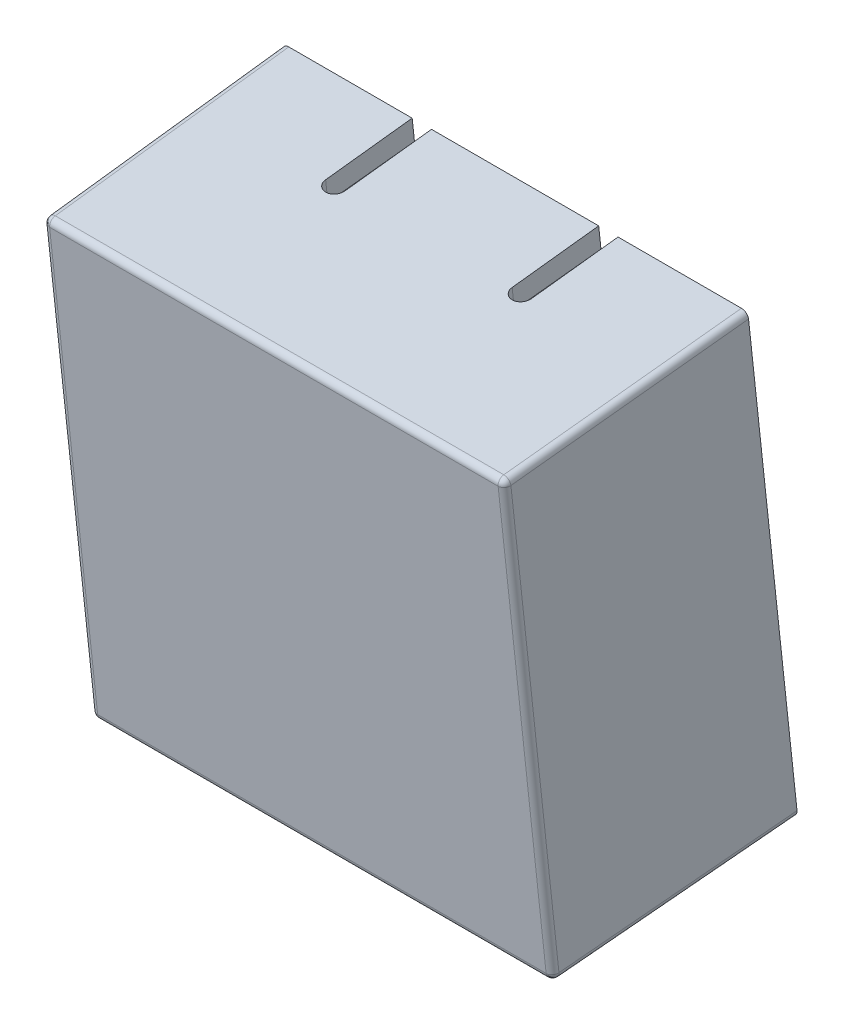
ISO-10303-21;
HEADER;
FILE_DESCRIPTION(('STEP AP214'),'2;1');
FILE_NAME('part.step','',(''),(''),'','','');
FILE_SCHEMA(('AUTOMOTIVE_DESIGN { 1 0 10303 214 1 1 1 1 }'));
ENDSEC;
DATA;
#1=APPLICATION_CONTEXT('core data for automotive mechanical design processes');
#2=APPLICATION_PROTOCOL_DEFINITION('international standard','automotive_design',2000,#1);
#3=PRODUCT_CONTEXT('',#1,'mechanical');
#4=PRODUCT('Part','Part','',(#3));
#5=PRODUCT_RELATED_PRODUCT_CATEGORY('part','',(#4));
#6=PRODUCT_DEFINITION_FORMATION('','',#4);
#7=PRODUCT_DEFINITION_CONTEXT('part definition',#1,'design');
#8=PRODUCT_DEFINITION('design','',#6,#7);
#9=PRODUCT_DEFINITION_SHAPE('','',#8);
#10=(LENGTH_UNIT() NAMED_UNIT(*) SI_UNIT(.MILLI.,.METRE.));
#11=(NAMED_UNIT(*) PLANE_ANGLE_UNIT() SI_UNIT($,.RADIAN.));
#12=(NAMED_UNIT(*) SI_UNIT($,.STERADIAN.) SOLID_ANGLE_UNIT());
#13=UNCERTAINTY_MEASURE_WITH_UNIT(LENGTH_MEASURE(1.E-05),#10,'distance_accuracy_value','');
#14=(GEOMETRIC_REPRESENTATION_CONTEXT(3) GLOBAL_UNCERTAINTY_ASSIGNED_CONTEXT((#13)) GLOBAL_UNIT_ASSIGNED_CONTEXT((#10,
#11,#12)) REPRESENTATION_CONTEXT('',''));
#15=CARTESIAN_POINT('',(0.,0.,0.));
#16=DIRECTION('',(0.,0.,1.));
#17=DIRECTION('',(1.,0.,0.));
#18=AXIS2_PLACEMENT_3D('',#15,#16,#17);
#19=CARTESIAN_POINT('',(5247.047089,166.5918275,-23.9628614));
#20=DIRECTION('',(0.,-0.107073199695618,0.994251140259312));
#21=DIRECTION('',(0.,-0.994251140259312,-0.107073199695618));
#22=AXIS2_PLACEMENT_3D('',#19,#20,#21);
#23=PLANE('',#22);
#24=DIRECTION('',(-1.,0.,0.));
#25=VECTOR('',#24,1.);
#26=CARTESIAN_POINT('',(5239.8172815,152.491810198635,-25.4813247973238));
#27=LINE('',#26,#25);
#28=CARTESIAN_POINT('',(5232.865544,152.491810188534,-25.4813247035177));
#29=VERTEX_POINT('',#28);
#30=CARTESIAN_POINT('',(5246.769019,152.491810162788,-25.4813247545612));
#31=VERTEX_POINT('',#30);
#32=EDGE_CURVE('E293',#29,#31,#27,.F.);
#33=ORIENTED_EDGE('',*,*,#32,.T.);
#34=DIRECTION('',(0.,-0.994251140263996,-0.107073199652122));
#35=VECTOR('',#34,1.);
#36=CARTESIAN_POINT('',(5246.769019,159.403583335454,-24.7369800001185));
#37=LINE('',#36,#35);
#38=CARTESIAN_POINT('',(5246.769019,166.315356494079,-23.9926351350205));
#39=VERTEX_POINT('',#38);
#40=EDGE_CURVE('E591',#31,#39,#37,.F.);
#41=ORIENTED_EDGE('',*,*,#40,.T.);
#42=DIRECTION('',(1.,0.,0.));
#43=VECTOR('',#42,1.);
#44=CARTESIAN_POINT('',(5239.8172815,166.315356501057,-23.9926351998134));
#45=LINE('',#44,#43);
#46=CARTESIAN_POINT('',(5232.865544,166.315356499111,-23.9926350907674));
#47=VERTEX_POINT('',#46);
#48=EDGE_CURVE('E609',#39,#47,#45,.F.);
#49=ORIENTED_EDGE('',*,*,#48,.T.);
#50=DIRECTION('',(0.,0.994251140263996,0.107073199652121));
#51=VECTOR('',#50,1.);
#52=CARTESIAN_POINT('',(5232.865544,159.403583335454,-24.7369800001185));
#53=LINE('',#52,#51);
#54=EDGE_CURVE('E594',#47,#29,#53,.F.);
#55=ORIENTED_EDGE('',*,*,#54,.T.);
#56=EDGE_LOOP('',(#33,#41,#49,#55));
#57=FACE_BOUND('',#56,.T.);
#58=ADVANCED_FACE('F16',(#57),#23,.T.);
#59=CARTESIAN_POINT('',(5246.910441,152.3726165,-25.69531747));
#60=CARTESIAN_POINT('',(5246.910441,152.3512018,-25.49646724));
#61=CARTESIAN_POINT('',(5246.769019,152.4918102,-25.48132481));
#62=CARTESIAN_POINT('',(5247.051862,152.5132248,-25.68017503));
#63=CARTESIAN_POINT('',(5247.051862,152.4918102,-25.4813248));
#64=CARTESIAN_POINT('',(5246.769019,152.4918102,-25.48132481));
#65=CARTESIAN_POINT('',(5246.910441,152.6538331,-25.6650326));
#66=CARTESIAN_POINT('',(5246.910441,152.6324185,-25.46618237));
#67=CARTESIAN_POINT('',(5246.769019,152.4918102,-25.48132481));
#68=(BOUNDED_SURFACE() B_SPLINE_SURFACE(2,2,((#59,#60,#61),(#62,#63,#64),(#65,#66,#67)),
.UNSPECIFIED.,.F.,.F.,.F.) B_SPLINE_SURFACE_WITH_KNOTS((3,3),(3,3),(-44.51999879,-44.27999879),
(-89.56318102,-89.12636203),
.UNSPECIFIED.) GEOMETRIC_REPRESENTATION_ITEM() RATIONAL_B_SPLINE_SURFACE(((1.,0.7071067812,1.),
(0.7071067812,0.5,0.7071067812),(1.,0.7071067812,1.))) REPRESENTATION_ITEM('') SURFACE());
#69=CARTESIAN_POINT('',(5246.769018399,152.513224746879,-25.6801750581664));
#70=DIRECTION('',(-0.00872625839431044,-0.0983890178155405,0.995109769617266));
#71=DIRECTION('',(0.,-0.995147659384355,-0.0983927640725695));
#72=AXIS2_PLACEMENT_3D('',#69,#70,#71);
#73=CIRCLE('',#72,0.20000025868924);
#74=CARTESIAN_POINT('',(5246.91042967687,152.372362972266,-25.6928623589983));
#75=VERTEX_POINT('',#74);
#76=CARTESIAN_POINT('',(5246.96901120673,152.513037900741,-25.678439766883));
#77=VERTEX_POINT('',#76);
#78=EDGE_CURVE('E20',#75,#77,#73,.T.);
#79=CARTESIAN_POINT('',(5246.76901898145,152.513224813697,-25.6801750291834));
#80=DIRECTION('',(1.91222935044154E-07,0.994251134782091,0.107073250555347));
#81=DIRECTION('',(0.,-0.107073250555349,0.994251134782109));
#82=AXIS2_PLACEMENT_3D('',#79,#80,#81);
#83=CIRCLE('',#82,0.200000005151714);
#84=CARTESIAN_POINT('',(5246.90982197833,152.498016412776,-25.5389545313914));
#85=VERTEX_POINT('',#84);
#86=EDGE_CURVE('E647',#77,#85,#83,.F.);
#87=CARTESIAN_POINT('',(5246.76901899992,152.5132247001,-25.6801750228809));
#88=DIRECTION('',(-1.42207487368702E-07,0.994251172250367,0.107072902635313));
#89=DIRECTION('',(0.,-0.107072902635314,0.994251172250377));
#90=AXIS2_PLACEMENT_3D('',#87,#88,#89);
#91=CIRCLE('',#90,0.199999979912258);
#92=EDGE_CURVE('E287',#85,#31,#91,.F.);
#93=CARTESIAN_POINT('',(5246.76901903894,152.513224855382,-25.6801749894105));
#94=DIRECTION('',(-0.70710530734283,-0.703043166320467,-0.0757125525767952));
#95=DIRECTION('',(0.70506693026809,-0.709140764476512,0.));
#96=AXIS2_PLACEMENT_3D('',#93,#94,#95);
#97=CIRCLE('',#96,0.20000019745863);
#98=EDGE_CURVE('E285',#31,#75,#97,.F.);
#99=ORIENTED_EDGE('',*,*,#78,.T.);
#100=ORIENTED_EDGE('',*,*,#86,.T.);
#101=ORIENTED_EDGE('',*,*,#92,.T.);
#102=ORIENTED_EDGE('',*,*,#98,.T.);
#103=EDGE_LOOP('',(#99,#100,#101,#102));
#104=FACE_BOUND('',#103,.T.);
#105=ADVANCED_FACE('F286',(#104),#68,.T.);
#106=CARTESIAN_POINT('',(5246.76901896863,166.336771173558,-24.191485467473));
#107=DIRECTION('',(-2.70398687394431E-09,-0.107073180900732,0.994251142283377));
#108=DIRECTION('',(0.707108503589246,0.703040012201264,0.0757119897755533));
#109=AXIS2_PLACEMENT_3D('',#106,#107,#108);
#110=SPHERICAL_SURFACE('',#109,0.200000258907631);
#111=CARTESIAN_POINT('',(5246.91043008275,166.477104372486,-24.1738901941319));
#112=CARTESIAN_POINT('',(5246.90811642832,166.479406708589,-24.1736573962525));
#113=CARTESIAN_POINT('',(5246.90574588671,166.481652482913,-24.1734306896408));
#114=CARTESIAN_POINT('',(5246.90089693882,166.48602573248,-24.1729900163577));
#115=CARTESIAN_POINT('',(5246.89841853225,166.4881532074,-24.1727760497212));
#116=CARTESIAN_POINT('',(5246.89335977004,166.492284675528,-24.1723614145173));
#117=CARTESIAN_POINT('',(5246.89077941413,166.494288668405,-24.1721607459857));
#118=CARTESIAN_POINT('',(5246.88552298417,166.49816836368,-24.1717732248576));
#119=CARTESIAN_POINT('',(5246.88284690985,166.50004406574,-24.1715863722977));
#120=CARTESIAN_POINT('',(5246.87740548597,166.503662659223,-24.1712269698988));
#121=CARTESIAN_POINT('',(5246.87464013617,166.505405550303,-24.1710544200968));
#122=CARTESIAN_POINT('',(5246.86902682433,166.508754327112,-24.1707240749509));
#123=CARTESIAN_POINT('',(5246.86617886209,166.510360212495,-24.1705662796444));
#124=CARTESIAN_POINT('',(5246.86040718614,166.513431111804,-24.1702658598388));
#125=CARTESIAN_POINT('',(5246.85748347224,166.514896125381,-24.1701232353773));
#126=CARTESIAN_POINT('',(5246.85156733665,166.517681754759,-24.1698535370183));
#127=CARTESIAN_POINT('',(5246.84857491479,166.519002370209,-24.1697264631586));
#128=CARTESIAN_POINT('',(5246.84252857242,166.521496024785,-24.1694882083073));
#129=CARTESIAN_POINT('',(5246.83947465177,166.522669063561,-24.1693770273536));
#130=CARTESIAN_POINT('',(5246.83331266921,166.52486474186,-24.1691708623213));
#131=CARTESIAN_POINT('',(5246.83020460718,166.525887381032,-24.1690758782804));
#132=CARTESIAN_POINT('',(5246.8239418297,166.527779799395,-24.1689023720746));
#133=CARTESIAN_POINT('',(5246.82078711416,166.528649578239,-24.1688238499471));
#134=CARTESIAN_POINT('',(5246.81443862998,166.530234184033,-24.1686834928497));
#135=CARTESIAN_POINT('',(5246.81124486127,166.530949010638,-24.1686216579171));
#136=CARTESIAN_POINT('',(5246.8048259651,166.532221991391,-24.1685148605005));
#137=CARTESIAN_POINT('',(5246.80160083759,166.532780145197,-24.1684698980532));
#138=CARTESIAN_POINT('',(5246.79512699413,166.533738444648,-24.1683969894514));
#139=CARTESIAN_POINT('',(5246.79187827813,166.534138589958,-24.168369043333));
#140=CARTESIAN_POINT('',(5246.78536508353,166.534779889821,-24.1683302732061));
#141=CARTESIAN_POINT('',(5246.78210060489,166.535021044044,-24.168319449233));
#142=CARTESIAN_POINT('',(5246.77556375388,166.535343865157,-24.1683149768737));
#143=CARTESIAN_POINT('',(5246.7722913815,166.535425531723,-24.1683213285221));
#144=CARTESIAN_POINT('',(5246.76901899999,166.535427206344,-24.1683362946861));
#145=B_SPLINE_CURVE_WITH_KNOTS('',3,(#111,#112,#113,#114,#115,#116,#117,#118,#119,#120,#121,
#122,#123,#124,#125,#126,#127,#128,#129,#130,#131,#132,#133,#134,#135,#136,#137,#138,#139,#140,
#141,#142,#143,#144),.UNSPECIFIED.,.F.,.F.,(4,2,2,2,2,2,2,2,2,2,2,2,2,2,2,2,4),(0.,
0.00981590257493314,0.0196318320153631,0.0294477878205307,0.0392637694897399,0.0490797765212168,
0.0588958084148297,0.06871186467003,0.078527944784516,0.0883440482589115,0.0981601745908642,
0.107976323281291,0.117792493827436,0.127608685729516,0.137424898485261,0.147241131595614,
0.157057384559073),.UNSPECIFIED.);
#146=CARTESIAN_POINT('',(5246.91042976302,166.477104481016,-24.1738901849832));
#147=VERTEX_POINT('',#146);
#148=CARTESIAN_POINT('',(5246.76901899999,166.535427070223,-24.1683363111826));
#149=VERTEX_POINT('',#148);
#150=EDGE_CURVE('E335',#147,#149,#145,.T.);
#151=ORIENTED_EDGE('',*,*,#150,.T.);
#152=CARTESIAN_POINT('',(5246.769019,166.33677113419,-24.1914854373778));
#153=DIRECTION('',(-1.,0.,0.));
#154=DIRECTION('',(0.,0.,1.));
#155=AXIS2_PLACEMENT_3D('',#152,#153,#154);
#156=CIRCLE('',#155,0.200000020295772);
#157=EDGE_CURVE('E331',#149,#39,#156,.F.);
#158=ORIENTED_EDGE('',*,*,#157,.T.);
#159=CARTESIAN_POINT('',(5246.76901899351,166.336771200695,-24.1914854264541));
#160=DIRECTION('',(-4.37377027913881E-08,0.994251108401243,0.107073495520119));
#161=DIRECTION('',(0.,-0.107073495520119,0.994251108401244));
#162=AXIS2_PLACEMENT_3D('',#159,#160,#161);
#163=CIRCLE('',#162,0.20000011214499);
#164=CARTESIAN_POINT('',(5246.9098220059,166.321562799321,-24.0502648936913));
#165=VERTEX_POINT('',#164);
#166=EDGE_CURVE('E613',#165,#39,#163,.F.);
#167=ORIENTED_EDGE('',*,*,#166,.F.);
#168=CARTESIAN_POINT('',(5246.76901898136,166.336771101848,-24.1914854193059));
#169=DIRECTION('',(4.84772643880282E-07,-0.994251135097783,-0.107073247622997));
#170=DIRECTION('',(0.,0.10707324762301,-0.9942511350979));
#171=AXIS2_PLACEMENT_3D('',#168,#169,#170);
#172=CIRCLE('',#171,0.200000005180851);
#173=CARTESIAN_POINT('',(5246.96901125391,166.336584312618,-24.1897501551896));
#174=VERTEX_POINT('',#173);
#175=EDGE_CURVE('E649',#165,#174,#172,.F.);
#176=ORIENTED_EDGE('',*,*,#175,.T.);
#177=CARTESIAN_POINT('',(5246.96901127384,166.336584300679,-24.1897501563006));
#178=CARTESIAN_POINT('',(5246.96901121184,166.339836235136,-24.189384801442));
#179=CARTESIAN_POINT('',(5246.9689306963,166.343088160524,-24.1890194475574));
#180=CARTESIAN_POINT('',(5246.96860925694,166.349584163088,-24.1882895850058));
#181=CARTESIAN_POINT('',(5246.96836833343,166.35282824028,-24.1879250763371));
#182=CARTESIAN_POINT('',(5246.96772657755,166.359300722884,-24.1871977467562));
#183=CARTESIAN_POINT('',(5246.9673257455,166.362529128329,-24.1868349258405));
#184=CARTESIAN_POINT('',(5246.96636516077,166.368962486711,-24.1861118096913));
#185=CARTESIAN_POINT('',(5246.96580540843,166.372167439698,-24.1857515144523));
#186=CARTESIAN_POINT('',(5246.96452832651,166.37854616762,-24.1850342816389));
#187=CARTESIAN_POINT('',(5246.96381099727,166.381719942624,-24.1846773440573));
#188=CARTESIAN_POINT('',(5246.96222049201,166.388028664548,-24.1839676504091));
#189=CARTESIAN_POINT('',(5246.96134731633,166.391163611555,-24.1836148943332));
#190=CARTESIAN_POINT('',(5246.95944722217,166.397387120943,-24.1829143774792));
#191=CARTESIAN_POINT('',(5246.95842030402,166.400475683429,-24.1825666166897));
#192=CARTESIAN_POINT('',(5246.95621519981,166.406598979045,-24.1818768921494));
#193=CARTESIAN_POINT('',(5246.9550370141,166.409633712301,-24.1815349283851));
#194=CARTESIAN_POINT('',(5246.95253221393,166.415642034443,-24.1808575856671));
#195=CARTESIAN_POINT('',(5246.95120559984,166.418615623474,-24.1805222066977));
#196=CARTESIAN_POINT('',(5246.94840713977,166.424494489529,-24.1798588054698));
#197=CARTESIAN_POINT('',(5246.94693529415,166.427399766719,-24.1795307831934));
#198=CARTESIAN_POINT('',(5246.94384991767,166.433135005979,-24.178882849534));
#199=CARTESIAN_POINT('',(5246.94223638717,166.435964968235,-24.1785629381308));
#200=CARTESIAN_POINT('',(5246.9388715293,166.441542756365,-24.1779319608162));
#201=CARTESIAN_POINT('',(5246.93712020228,166.444290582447,-24.1776208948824));
#202=CARTESIAN_POINT('',(5246.93348397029,166.449697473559,-24.1770083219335));
#203=CARTESIAN_POINT('',(5246.93159906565,166.45235653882,-24.1767068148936));
#204=CARTESIAN_POINT('',(5246.92770022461,166.457579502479,-24.17611404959));
#205=CARTESIAN_POINT('',(5246.92568628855,166.46014340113,-24.1758227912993));
#206=CARTESIAN_POINT('',(5246.92153422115,166.465169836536,-24.1752511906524));
#207=CARTESIAN_POINT('',(5246.91939609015,166.467632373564,-24.174970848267));
#208=CARTESIAN_POINT('',(5246.91500084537,166.472450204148,-24.1744217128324));
#209=CARTESIAN_POINT('',(5246.91274373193,166.474805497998,-24.1741529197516));
#210=CARTESIAN_POINT('',(5246.91042973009,166.477104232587,-24.1738902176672));
#211=B_SPLINE_CURVE_WITH_KNOTS('',3,(#177,#178,#179,#180,#181,#182,#183,#184,#185,#186,#187,
#188,#189,#190,#191,#192,#193,#194,#195,#196,#197,#198,#199,#200,#201,#202,#203,#204,#205,#206,
#207,#208,#209,#210),.UNSPECIFIED.,.F.,.F.,(4,2,2,2,2,2,2,2,2,2,2,2,2,2,2,2,4),(0.,
0.00981618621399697,0.0196323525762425,0.0294484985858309,0.039264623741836,0.049080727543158,
0.0588968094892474,0.0687128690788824,0.0785289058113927,0.0883449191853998,0.0981609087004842,
0.10797687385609,0.117792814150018,0.127608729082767,0.137424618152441,0.147240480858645,
0.15705631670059),.UNSPECIFIED.);
#212=EDGE_CURVE('E339',#174,#147,#211,.T.);
#213=ORIENTED_EDGE('',*,*,#212,.T.);
#214=EDGE_LOOP('',(#151,#158,#167,#176,#213));
#215=FACE_BOUND('',#214,.T.);
#216=ADVANCED_FACE('F351',(#215),#110,.T.);
#217=CARTESIAN_POINT('',(5233.006965,166.4773795,-24.17634299));
#218=CARTESIAN_POINT('',(5233.006965,166.4559649,-23.97749276));
#219=CARTESIAN_POINT('',(5232.865544,166.3153565,-23.99263519));
#220=CARTESIAN_POINT('',(5232.865544,166.6179879,-24.16120055));
#221=CARTESIAN_POINT('',(5232.865544,166.5965732,-23.96235032));
#222=CARTESIAN_POINT('',(5232.865544,166.3153565,-23.99263519));
#223=CARTESIAN_POINT('',(5232.724122,166.4773795,-24.17634299));
#224=CARTESIAN_POINT('',(5232.724122,166.4559649,-23.97749276));
#225=CARTESIAN_POINT('',(5232.865544,166.3153565,-23.99263519));
#226=(BOUNDED_SURFACE() B_SPLINE_SURFACE(2,2,((#217,#218,#219),(#220,#221,#222),(#223,#224,
#225)),.UNSPECIFIED.,.F.,.F.,.F.) B_SPLINE_SURFACE_WITH_KNOTS((3,3),(3,3),(135.24,135.48),
(-89.56318102,-89.12636203),
.UNSPECIFIED.) GEOMETRIC_REPRESENTATION_ITEM() RATIONAL_B_SPLINE_SURFACE(((1.,0.7071067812,1.),
(0.7071067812,0.5,0.7071067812),(1.,0.7071067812,1.))) REPRESENTATION_ITEM('') SURFACE());
#227=CARTESIAN_POINT('',(5232.86554398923,166.336771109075,-24.1914854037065));
#228=DIRECTION('',(-0.707105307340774,-0.703043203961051,-0.0757122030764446));
#229=DIRECTION('',(0.705066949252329,-0.709140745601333,0.));
#230=AXIS2_PLACEMENT_3D('',#227,#228,#229);
#231=CIRCLE('',#230,0.200000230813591);
#232=CARTESIAN_POINT('',(5232.72413282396,166.477104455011,-24.173890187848));
#233=VERTEX_POINT('',#232);
#234=EDGE_CURVE('E596',#233,#47,#231,.F.);
#235=CARTESIAN_POINT('',(5232.865544,166.33677113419,-24.1914854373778));
#236=DIRECTION('',(1.,-6.24127284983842E-12,-6.99698253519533E-13));
#237=DIRECTION('',(6.24127284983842E-12,1.,0.));
#238=AXIS2_PLACEMENT_3D('',#235,#236,#237);
#239=CIRCLE('',#238,0.20000002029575);
#240=CARTESIAN_POINT('',(5232.865544,166.535426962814,-24.1683363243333));
#241=VERTEX_POINT('',#240);
#242=EDGE_CURVE('E334',#47,#241,#239,.F.);
#243=CARTESIAN_POINT('',(5232.86554373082,166.336771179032,-24.1914854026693));
#244=DIRECTION('',(0.00872612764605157,-0.115741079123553,0.993241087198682));
#245=DIRECTION('',(0.,-0.993278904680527,-0.115745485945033));
#246=AXIS2_PLACEMENT_3D('',#243,#244,#245);
#247=CIRCLE('',#246,0.200000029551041);
#248=EDGE_CURVE('E325',#241,#233,#247,.T.);
#249=ORIENTED_EDGE('',*,*,#234,.T.);
#250=ORIENTED_EDGE('',*,*,#242,.T.);
#251=ORIENTED_EDGE('',*,*,#248,.T.);
#252=EDGE_LOOP('',(#249,#250,#251));
#253=FACE_BOUND('',#252,.T.);
#254=ADVANCED_FACE('F360',(#253),#226,.T.);
#255=CARTESIAN_POINT('',(5232.724122,152.6538331,-25.6650326));
#256=CARTESIAN_POINT('',(5232.724122,152.6324185,-25.46618237));
#257=CARTESIAN_POINT('',(5232.865544,152.4918102,-25.48132481));
#258=CARTESIAN_POINT('',(5232.582701,152.5132248,-25.68017503));
#259=CARTESIAN_POINT('',(5232.582701,152.4918102,-25.48132481));
#260=CARTESIAN_POINT('',(5232.865544,152.4918102,-25.48132481));
#261=CARTESIAN_POINT('',(5232.724122,152.3726165,-25.69531747));
#262=CARTESIAN_POINT('',(5232.724122,152.3512018,-25.49646724));
#263=CARTESIAN_POINT('',(5232.865544,152.4918102,-25.48132481));
#264=CARTESIAN_POINT('',(5232.72512199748,152.371622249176,-25.6954245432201));
#265=CARTESIAN_POINT('',(5232.72512199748,152.350207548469,-25.4965743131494));
#266=CARTESIAN_POINT('',(5232.865544,152.4918102,-25.48132481));
#267=CARTESIAN_POINT('',(5232.72612199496,152.370627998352,-25.6955316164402));
#268=CARTESIAN_POINT('',(5232.72612199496,152.349213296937,-25.4966813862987));
#269=CARTESIAN_POINT('',(5232.865544,152.4918102,-25.48132481));
#270=(BOUNDED_SURFACE() B_SPLINE_SURFACE(2,2,((#255,#256,#257),(#258,#259,#260),(#261,#262,
#263),(#264,#265,#266),(#267,#268,#269)),.UNSPECIFIED.,.F.,.F.,
.F.) B_SPLINE_SURFACE_WITH_KNOTS((3,2,3),(3,3),(-134.760001,-134.520001,-134.517601),
(-89.56318102,-89.12636203),
.UNSPECIFIED.) GEOMETRIC_REPRESENTATION_ITEM() RATIONAL_B_SPLINE_SURFACE(((1.,0.7071067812,1.),
(0.7071067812,0.5,0.7071067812),(1.,0.7071067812,1.),(1.,0.7071067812,1.),(1.,0.7071067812,1.))) REPRESENTATION_ITEM('') SURFACE());
#271=CARTESIAN_POINT('',(5232.86554399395,152.513224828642,-25.6801750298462));
#272=DIRECTION('',(5.10991314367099E-07,-0.994251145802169,-0.107073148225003));
#273=DIRECTION('',(0.,0.107073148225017,-0.994251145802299));
#274=AXIS2_PLACEMENT_3D('',#271,#272,#273);
#275=CIRCLE('',#274,0.200000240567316);
#276=CARTESIAN_POINT('',(5232.72474096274,152.498016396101,-25.5389544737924));
#277=VERTEX_POINT('',#276);
#278=EDGE_CURVE('E608',#277,#29,#275,.F.);
#279=CARTESIAN_POINT('',(5232.86554401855,152.513224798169,-25.6801750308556));
#280=DIRECTION('',(-1.91222737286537E-07,0.994251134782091,0.107073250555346));
#281=DIRECTION('',(0.,-0.107073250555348,0.994251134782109));
#282=AXIS2_PLACEMENT_3D('',#279,#280,#281);
#283=CIRCLE('',#282,0.200000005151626);
#284=CARTESIAN_POINT('',(5232.66555123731,152.513037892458,-25.678439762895));
#285=VERTEX_POINT('',#284);
#286=EDGE_CURVE('E328',#277,#285,#283,.F.);
#287=CARTESIAN_POINT('',(5232.86554360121,152.513224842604,-25.6801750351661));
#288=DIRECTION('',(0.00872625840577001,-0.0983890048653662,0.995109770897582));
#289=DIRECTION('',(0.,-0.995147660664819,-0.098392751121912));
#290=AXIS2_PLACEMENT_3D('',#287,#288,#289);
#291=CIRCLE('',#290,0.199999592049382);
#292=CARTESIAN_POINT('',(5232.72413300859,152.372363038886,-25.6928623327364));
#293=VERTEX_POINT('',#292);
#294=EDGE_CURVE('E319',#285,#293,#291,.T.);
#295=CARTESIAN_POINT('',(5232.86554396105,152.513224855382,-25.6801749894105));
#296=DIRECTION('',(0.707105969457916,-0.703042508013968,-0.0757124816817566));
#297=DIRECTION('',(0.705066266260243,0.709141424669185,0.));
#298=AXIS2_PLACEMENT_3D('',#295,#296,#297);
#299=CIRCLE('',#298,0.200000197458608);
#300=EDGE_CURVE('E282',#293,#29,#299,.F.);
#301=ORIENTED_EDGE('',*,*,#278,.F.);
#302=ORIENTED_EDGE('',*,*,#286,.T.);
#303=ORIENTED_EDGE('',*,*,#294,.T.);
#304=ORIENTED_EDGE('',*,*,#300,.T.);
#305=EDGE_LOOP('',(#301,#302,#303,#304));
#306=FACE_BOUND('',#305,.T.);
#307=ADVANCED_FACE('F548',(#306),#270,.T.);
#308=CARTESIAN_POINT('',(5232.724122,166.4773795,-24.17634299));
#309=CARTESIAN_POINT('',(5232.724122,166.4559649,-23.97749276));
#310=CARTESIAN_POINT('',(5232.865544,166.3153565,-23.99263519));
#311=CARTESIAN_POINT('',(5232.582701,166.3367712,-24.19148542));
#312=CARTESIAN_POINT('',(5232.582701,166.3153565,-23.99263519));
#313=CARTESIAN_POINT('',(5232.865544,166.3153565,-23.99263519));
#314=CARTESIAN_POINT('',(5232.724122,166.1961628,-24.20662786));
#315=CARTESIAN_POINT('',(5232.724122,166.1747482,-24.00777763));
#316=CARTESIAN_POINT('',(5232.865544,166.3153565,-23.99263519));
#317=(BOUNDED_SURFACE() B_SPLINE_SURFACE(2,2,((#308,#309,#310),(#311,#312,#313),(#314,#315,
#316)),.UNSPECIFIED.,.F.,.F.,.F.) B_SPLINE_SURFACE_WITH_KNOTS((3,3),(3,3),(135.48,135.72),
(-89.56318102,-89.12636203),
.UNSPECIFIED.) GEOMETRIC_REPRESENTATION_ITEM() RATIONAL_B_SPLINE_SURFACE(((1.,0.7071067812,1.),
(0.7071067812,0.5,0.7071067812),(1.,0.7071067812,1.))) REPRESENTATION_ITEM('') SURFACE());
#318=CARTESIAN_POINT('',(5232.86554266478,166.336771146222,-24.1914854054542));
#319=DIRECTION('',(0.00872612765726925,-0.115741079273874,0.993241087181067));
#320=DIRECTION('',(0.,-0.993278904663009,-0.115745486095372));
#321=AXIS2_PLACEMENT_3D('',#318,#319,#320);
#322=CIRCLE('',#321,0.199999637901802);
#323=CARTESIAN_POINT('',(5232.66555113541,166.336584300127,-24.1897501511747));
#324=VERTEX_POINT('',#323);
#325=EDGE_CURVE('E316',#233,#324,#322,.T.);
#326=CARTESIAN_POINT('',(5232.86554401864,166.336771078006,-24.1914854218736));
#327=DIRECTION('',(-4.84772551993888E-07,-0.994251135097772,-0.107073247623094));
#328=DIRECTION('',(0.,0.107073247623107,-0.994251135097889));
#329=AXIS2_PLACEMENT_3D('',#326,#327,#328);
#330=CIRCLE('',#329,0.20000000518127);
#331=CARTESIAN_POINT('',(5232.72474095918,166.321562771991,-24.0502648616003));
#332=VERTEX_POINT('',#331);
#333=EDGE_CURVE('E324',#324,#332,#330,.F.);
#334=CARTESIAN_POINT('',(5232.86554400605,166.336771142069,-24.1914854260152));
#335=DIRECTION('',(-1.4899113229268E-09,0.99425113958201,0.107073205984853));
#336=DIRECTION('',(0.,-0.107073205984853,0.99425113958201));
#337=AXIS2_PLACEMENT_3D('',#334,#335,#336);
#338=CIRCLE('',#337,0.200000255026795);
#339=EDGE_CURVE('E599',#47,#332,#338,.F.);
#340=ORIENTED_EDGE('',*,*,#325,.T.);
#341=ORIENTED_EDGE('',*,*,#333,.T.);
#342=ORIENTED_EDGE('',*,*,#339,.F.);
#343=ORIENTED_EDGE('',*,*,#234,.F.);
#344=EDGE_LOOP('',(#340,#341,#342,#343));
#345=FACE_BOUND('',#344,.T.);
#346=ADVANCED_FACE('F538',(#345),#317,.T.);
#347=CARTESIAN_POINT('',(5246.627598,152.3726164,-25.69531747));
#348=CARTESIAN_POINT('',(5246.627598,152.3512018,-25.49646724));
#349=CARTESIAN_POINT('',(5246.769019,152.4918102,-25.48132481));
#350=CARTESIAN_POINT('',(5246.769019,152.2320081,-25.71045991));
#351=CARTESIAN_POINT('',(5246.769019,152.2105935,-25.51160968));
#352=CARTESIAN_POINT('',(5246.769019,152.4918102,-25.48132481));
#353=CARTESIAN_POINT('',(5246.910441,152.3726165,-25.69531747));
#354=CARTESIAN_POINT('',(5246.910441,152.3512018,-25.49646724));
#355=CARTESIAN_POINT('',(5246.769019,152.4918102,-25.48132481));
#356=(BOUNDED_SURFACE() B_SPLINE_SURFACE(2,2,((#347,#348,#349),(#350,#351,#352),(#353,#354,
#355)),.UNSPECIFIED.,.F.,.F.,.F.) B_SPLINE_SURFACE_WITH_KNOTS((3,3),(3,3),(-44.75999879,
-44.51999879),(-89.56318102,-89.12636203),
.UNSPECIFIED.) GEOMETRIC_REPRESENTATION_ITEM() RATIONAL_B_SPLINE_SURFACE(((1.,0.7071067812,1.),
(0.7071067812,0.5,0.7071067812),(1.,0.7071067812,1.))) REPRESENTATION_ITEM('') SURFACE());
#357=CARTESIAN_POINT('',(5246.769019,152.513224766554,-25.6801750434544));
#358=DIRECTION('',(-1.,0.,0.));
#359=DIRECTION('',(0.,0.,1.));
#360=AXIS2_PLACEMENT_3D('',#357,#358,#359);
#361=CIRCLE('',#360,0.199999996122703);
#362=CARTESIAN_POINT('',(5246.76901913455,152.314195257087,-25.699853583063));
#363=VERTEX_POINT('',#362);
#364=EDGE_CURVE('E304',#31,#363,#361,.F.);
#365=CARTESIAN_POINT('',(5246.76901926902,152.513224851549,-25.6801750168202));
#366=DIRECTION('',(-0.00872612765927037,-0.0983890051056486,0.995109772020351));
#367=DIRECTION('',(0.,-0.995147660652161,-0.0983927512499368));
#368=AXIS2_PLACEMENT_3D('',#365,#366,#367);
#369=CIRCLE('',#368,0.200000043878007);
#370=EDGE_CURVE('E298',#363,#75,#369,.T.);
#371=ORIENTED_EDGE('',*,*,#98,.F.);
#372=ORIENTED_EDGE('',*,*,#364,.T.);
#373=ORIENTED_EDGE('',*,*,#370,.T.);
#374=EDGE_LOOP('',(#371,#372,#373));
#375=FACE_BOUND('',#374,.T.);
#376=ADVANCED_FACE('F303',(#375),#356,.T.);
#377=CARTESIAN_POINT('',(5232.724122,152.3726165,-25.69531747));
#378=CARTESIAN_POINT('',(5232.724122,152.3512018,-25.49646724));
#379=CARTESIAN_POINT('',(5232.865544,152.4918102,-25.48132481));
#380=CARTESIAN_POINT('',(5232.865544,152.2320081,-25.71045991));
#381=CARTESIAN_POINT('',(5232.865544,152.2105935,-25.51160968));
#382=CARTESIAN_POINT('',(5232.865544,152.4918102,-25.48132481));
#383=CARTESIAN_POINT('',(5233.006965,152.3726164,-25.69531747));
#384=CARTESIAN_POINT('',(5233.006965,152.3512018,-25.49646724));
#385=CARTESIAN_POINT('',(5232.865544,152.4918102,-25.48132481));
#386=(BOUNDED_SURFACE() B_SPLINE_SURFACE(2,2,((#377,#378,#379),(#380,#381,#382),(#383,#384,
#385)),.UNSPECIFIED.,.F.,.F.,.F.) B_SPLINE_SURFACE_WITH_KNOTS((3,3),(3,3),(-134.520001,
-134.280001),(-89.56318102,-89.12636203),
.UNSPECIFIED.) GEOMETRIC_REPRESENTATION_ITEM() RATIONAL_B_SPLINE_SURFACE(((1.,0.7071067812,1.),
(0.7071067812,0.5,0.7071067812),(1.,0.7071067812,1.))) REPRESENTATION_ITEM('') SURFACE());
#387=CARTESIAN_POINT('',(5232.86554373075,152.513224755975,-25.680175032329));
#388=DIRECTION('',(0.00872612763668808,-0.0983890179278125,0.995109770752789));
#389=DIRECTION('',(0.,-0.995147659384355,-0.0983927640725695));
#390=AXIS2_PLACEMENT_3D('',#387,#388,#389);
#391=CIRCLE('',#390,0.200000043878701);
#392=CARTESIAN_POINT('',(5232.86554386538,152.314195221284,-25.6998535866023));
#393=VERTEX_POINT('',#392);
#394=EDGE_CURVE('E301',#293,#393,#391,.T.);
#395=CARTESIAN_POINT('',(5232.865544,152.513224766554,-25.6801750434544));
#396=DIRECTION('',(1.,0.,0.));
#397=DIRECTION('',(0.,0.,-1.));
#398=AXIS2_PLACEMENT_3D('',#395,#396,#397);
#399=CIRCLE('',#398,0.199999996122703);
#400=CARTESIAN_POINT('',(5232.86554399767,152.358022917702,-25.5540307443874));
#401=VERTEX_POINT('',#400);
#402=EDGE_CURVE('E307',#393,#401,#399,.F.);
#403=CARTESIAN_POINT('',(5232.865544,152.513224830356,-25.6801750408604));
#404=DIRECTION('',(-0.999999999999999,4.92666009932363E-08,5.30563126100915E-09));
#405=DIRECTION('',(-4.92666009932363E-08,-0.999999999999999,0.));
#406=AXIS2_PLACEMENT_3D('',#403,#404,#405);
#407=CIRCLE('',#406,0.20000001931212);
#408=EDGE_CURVE('E292',#29,#401,#407,.F.);
#409=ORIENTED_EDGE('',*,*,#394,.T.);
#410=ORIENTED_EDGE('',*,*,#402,.T.);
#411=ORIENTED_EDGE('',*,*,#408,.F.);
#412=ORIENTED_EDGE('',*,*,#300,.F.);
#413=EDGE_LOOP('',(#409,#410,#411,#412));
#414=FACE_BOUND('',#413,.T.);
#415=ADVANCED_FACE('F367',(#414),#386,.T.);
#416=CARTESIAN_POINT('',(5246.83446611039,153.251151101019,-33.1435865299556));
#417=DIRECTION('',(-0.00872625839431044,-0.0983890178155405,0.995109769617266));
#418=DIRECTION('',(0.,-0.995147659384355,-0.0983927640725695));
#419=AXIS2_PLACEMENT_3D('',#416,#417,#418);
#420=CYLINDRICAL_SURFACE('',#419,0.20000025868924);
#421=CARTESIAN_POINT('',(5246.83316128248,153.23643909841,-32.994788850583));
#422=DIRECTION('',(0.,0.107073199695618,-0.994251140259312));
#423=DIRECTION('',(-0.707109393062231,0.703039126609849,0.0757119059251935));
#424=AXIS2_PLACEMENT_3D('',#421,#422,#423);
#425=ELLIPSE('',#424,0.200015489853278,0.20000025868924);
#426=CARTESIAN_POINT('',(5247.03316903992,153.23642392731,-32.9947904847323));
#427=VERTEX_POINT('',#426);
#428=CARTESIAN_POINT('',(5246.97459366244,153.095820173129,-33.0099324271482));
#429=VERTEX_POINT('',#428);
#430=EDGE_CURVE('E281',#427,#429,#425,.T.);
#431=ORIENTED_EDGE('',*,*,#430,.F.);
#432=DIRECTION('',(-0.00872620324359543,-0.0983890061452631,0.995109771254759));
#433=VECTOR('',#432,1.);
#434=CARTESIAN_POINT('',(5247.03316884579,153.236423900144,-32.9947904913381));
#435=LINE('',#434,#433);
#436=EDGE_CURVE('E277',#427,#77,#435,.T.);
#437=ORIENTED_EDGE('',*,*,#436,.T.);
#438=ORIENTED_EDGE('',*,*,#78,.F.);
#439=DIRECTION('',(-0.00872625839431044,-0.0983890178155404,0.995109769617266));
#440=VECTOR('',#439,1.);
#441=CARTESIAN_POINT('',(5246.9425115,152.73409145,-29.351397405));
#442=LINE('',#441,#440);
#443=EDGE_CURVE('E275',#75,#429,#442,.F.);
#444=ORIENTED_EDGE('',*,*,#443,.T.);
#445=EDGE_LOOP('',(#431,#437,#438,#444));
#446=FACE_BOUND('',#445,.T.);
#447=ADVANCED_FACE('F273',(#446),#420,.T.);
#448=CARTESIAN_POINT('',(5246.76901898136,166.613242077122,-24.1617116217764));
#449=DIRECTION('',(0.,-0.994251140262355,-0.107073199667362));
#450=DIRECTION('',(0.,0.107073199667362,-0.994251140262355));
#451=AXIS2_PLACEMENT_3D('',#448,#449,#450);
#452=CYLINDRICAL_SURFACE('',#451,0.200000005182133);
#453=ORIENTED_EDGE('',*,*,#86,.F.);
#454=DIRECTION('',(1.40539861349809E-12,0.99425114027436,0.107073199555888));
#455=VECTOR('',#454,1.);
#456=CARTESIAN_POINT('',(5246.9690111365,152.513037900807,-25.6784397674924));
#457=LINE('',#456,#455);
#458=EDGE_CURVE('E654',#77,#174,#457,.T.);
#459=ORIENTED_EDGE('',*,*,#458,.T.);
#460=ORIENTED_EDGE('',*,*,#175,.F.);
#461=ORIENTED_EDGE('',*,*,#166,.T.);
#462=ORIENTED_EDGE('',*,*,#40,.F.);
#463=ORIENTED_EDGE('',*,*,#92,.F.);
#464=EDGE_LOOP('',(#453,#459,#460,#461,#462,#463));
#465=FACE_BOUND('',#464,.T.);
#466=ADVANCED_FACE('F366',(#465),#452,.T.);
#467=CARTESIAN_POINT('',(5246.83446600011,167.204839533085,-31.6408816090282));
#468=DIRECTION('',(-0.00872625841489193,-0.115741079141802,0.993241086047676));
#469=DIRECTION('',(0.,-0.993278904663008,-0.115745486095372));
#470=AXIS2_PLACEMENT_3D('',#467,#468,#469);
#471=CYLINDRICAL_SURFACE('',#470,0.200000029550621);
#472=CARTESIAN_POINT('',(5246.83316117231,167.187532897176,-31.4923633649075));
#473=DIRECTION('',(0.,0.107073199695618,-0.994251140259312));
#474=DIRECTION('',(-0.707109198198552,-0.703039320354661,-0.0757119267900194));
#475=AXIS2_PLACEMENT_3D('',#472,#473,#474);
#476=ELLIPSE('',#475,0.200015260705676,0.200000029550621);
#477=CARTESIAN_POINT('',(5246.83317670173,167.386390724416,-31.4709479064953));
#478=VERTEX_POINT('',#477);
#479=CARTESIAN_POINT('',(5247.03316904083,167.187548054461,-31.4923617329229));
#480=VERTEX_POINT('',#479);
#481=EDGE_CURVE('E332',#478,#480,#476,.T.);
#482=ORIENTED_EDGE('',*,*,#481,.F.);
#483=DIRECTION('',(-0.00872624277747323,-0.115741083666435,0.993241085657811));
#484=VECTOR('',#483,1.);
#485=CARTESIAN_POINT('',(5246.833177,167.38639074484,-31.4709479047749));
#486=LINE('',#485,#484);
#487=EDGE_CURVE('E669',#478,#149,#486,.T.);
#488=ORIENTED_EDGE('',*,*,#487,.T.);
#489=ORIENTED_EDGE('',*,*,#150,.F.);
#490=ORIENTED_EDGE('',*,*,#212,.F.);
#491=DIRECTION('',(0.00872620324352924,0.11574108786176,-0.993241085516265));
#492=VECTOR('',#491,1.);
#493=CARTESIAN_POINT('',(5246.96901113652,166.336584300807,-24.1897501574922));
#494=LINE('',#493,#492);
#495=EDGE_CURVE('E657',#174,#480,#494,.T.);
#496=ORIENTED_EDGE('',*,*,#495,.T.);
#497=EDGE_LOOP('',(#482,#488,#489,#490,#496));
#498=FACE_BOUND('',#497,.T.);
#499=ADVANCED_FACE('F370',(#498),#471,.T.);
#500=CARTESIAN_POINT('',(5232.587474,166.33677113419,-24.1914854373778));
#501=DIRECTION('',(1.,0.,0.));
#502=DIRECTION('',(0.,0.,-1.));
#503=AXIS2_PLACEMENT_3D('',#500,#501,#502);
#504=CYLINDRICAL_SURFACE('',#503,0.200000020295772);
#505=ORIENTED_EDGE('',*,*,#157,.F.);
#506=DIRECTION('',(1.,0.,0.));
#507=VECTOR('',#506,1.);
#508=CARTESIAN_POINT('',(5247.113813,166.535426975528,-24.1683363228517));
#509=LINE('',#508,#507);
#510=EDGE_CURVE('E665',#149,#241,#509,.F.);
#511=ORIENTED_EDGE('',*,*,#510,.T.);
#512=ORIENTED_EDGE('',*,*,#242,.F.);
#513=ORIENTED_EDGE('',*,*,#48,.F.);
#514=EDGE_LOOP('',(#505,#511,#512,#513));
#515=FACE_BOUND('',#514,.T.);
#516=ADVANCED_FACE('F374',(#515),#504,.T.);
#517=CARTESIAN_POINT('',(5232.80009699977,167.204839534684,-31.6408816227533));
#518=DIRECTION('',(0.00872612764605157,-0.115741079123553,0.993241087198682));
#519=DIRECTION('',(0.,-0.993278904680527,-0.115745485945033));
#520=AXIS2_PLACEMENT_3D('',#517,#518,#519);
#521=CYLINDRICAL_SURFACE('',#520,0.200000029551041);
#522=ORIENTED_EDGE('',*,*,#248,.F.);
#523=DIRECTION('',(-0.00872624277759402,0.115741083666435,-0.99324108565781));
#524=VECTOR('',#523,1.);
#525=CARTESIAN_POINT('',(5232.865544,166.535426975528,-24.1683363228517));
#526=LINE('',#525,#524);
#527=CARTESIAN_POINT('',(5232.8013862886,167.386390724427,-31.470947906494));
#528=VERTEX_POINT('',#527);
#529=EDGE_CURVE('E668',#241,#528,#526,.T.);
#530=ORIENTED_EDGE('',*,*,#529,.T.);
#531=CARTESIAN_POINT('',(5232.80140180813,167.187532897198,-31.4923633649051));
#532=DIRECTION('',(0.,0.107073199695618,-0.994251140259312));
#533=DIRECTION('',(0.707103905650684,-0.703044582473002,-0.0757124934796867));
#534=AXIS2_PLACEMENT_3D('',#531,#532,#533);
#535=ELLIPSE('',#534,0.200015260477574,0.200000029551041);
#536=CARTESIAN_POINT('',(5232.6599692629,167.328151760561,-31.4772197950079));
#537=VERTEX_POINT('',#536);
#538=EDGE_CURVE('E329',#537,#528,#535,.T.);
#539=ORIENTED_EDGE('',*,*,#538,.F.);
#540=DIRECTION('',(-0.00872612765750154,0.115741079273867,-0.993241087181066));
#541=VECTOR('',#540,1.);
#542=CARTESIAN_POINT('',(5232.69205088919,166.90262813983,-27.8255549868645));
#543=LINE('',#542,#541);
#544=EDGE_CURVE('E315',#537,#233,#543,.F.);
#545=ORIENTED_EDGE('',*,*,#544,.T.);
#546=EDGE_LOOP('',(#522,#530,#539,#545));
#547=FACE_BOUND('',#546,.T.);
#548=ADVANCED_FACE('F378',(#547),#521,.T.);
#549=CARTESIAN_POINT('',(5232.86554401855,152.236753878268,-25.7099488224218));
#550=DIRECTION('',(0.,0.994251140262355,0.107073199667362));
#551=DIRECTION('',(0.,-0.107073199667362,0.994251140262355));
#552=AXIS2_PLACEMENT_3D('',#549,#550,#551);
#553=CYLINDRICAL_SURFACE('',#552,0.200000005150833);
#554=ORIENTED_EDGE('',*,*,#333,.F.);
#555=DIRECTION('',(1.46928036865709E-12,-0.99425114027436,-0.107073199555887));
#556=VECTOR('',#555,1.);
#557=CARTESIAN_POINT('',(5232.66555084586,166.336584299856,-24.1897501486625));
#558=LINE('',#557,#556);
#559=EDGE_CURVE('E678',#324,#285,#558,.T.);
#560=ORIENTED_EDGE('',*,*,#559,.T.);
#561=ORIENTED_EDGE('',*,*,#286,.F.);
#562=ORIENTED_EDGE('',*,*,#278,.T.);
#563=ORIENTED_EDGE('',*,*,#54,.F.);
#564=ORIENTED_EDGE('',*,*,#339,.T.);
#565=EDGE_LOOP('',(#554,#560,#561,#562,#563,#564));
#566=FACE_BOUND('',#565,.T.);
#567=ADVANCED_FACE('F382',(#566),#553,.T.);
#568=CARTESIAN_POINT('',(5232.80009588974,153.251151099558,-33.1435865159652));
#569=DIRECTION('',(0.00872625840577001,-0.0983890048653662,0.995109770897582));
#570=DIRECTION('',(0.,-0.995147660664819,-0.098392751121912));
#571=AXIS2_PLACEMENT_3D('',#568,#569,#570);
#572=CYLINDRICAL_SURFACE('',#571,0.199999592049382);
#573=ORIENTED_EDGE('',*,*,#294,.F.);
#574=DIRECTION('',(-0.00872620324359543,0.0983890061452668,-0.995109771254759));
#575=VECTOR('',#574,1.);
#576=CARTESIAN_POINT('',(5232.66555084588,152.513037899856,-25.6784397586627));
#577=LINE('',#576,#575);
#578=CARTESIAN_POINT('',(5232.60139353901,153.236423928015,-32.9947904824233));
#579=VERTEX_POINT('',#578);
#580=EDGE_CURVE('E681',#285,#579,#577,.T.);
#581=ORIENTED_EDGE('',*,*,#580,.T.);
#582=CARTESIAN_POINT('',(5232.80140071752,153.236439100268,-32.994788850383));
#583=DIRECTION('',(0.,0.107073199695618,-0.994251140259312));
#584=DIRECTION('',(0.707108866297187,0.703039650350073,0.0757119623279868));
#585=AXIS2_PLACEMENT_3D('',#582,#583,#584);
#586=ELLIPSE('',#585,0.200014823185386,0.199999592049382);
#587=CARTESIAN_POINT('',(5232.6599692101,153.095820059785,-33.0099324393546));
#588=VERTEX_POINT('',#587);
#589=EDGE_CURVE('E322',#588,#579,#586,.T.);
#590=ORIENTED_EDGE('',*,*,#589,.F.);
#591=DIRECTION('',(-0.00872612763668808,0.0983890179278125,-0.995109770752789));
#592=VECTOR('',#591,1.);
#593=CARTESIAN_POINT('',(5232.692051,152.73409145,-29.351397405));
#594=LINE('',#593,#592);
#595=EDGE_CURVE('E641',#588,#293,#594,.F.);
#596=ORIENTED_EDGE('',*,*,#595,.T.);
#597=EDGE_LOOP('',(#573,#581,#590,#596));
#598=FACE_BOUND('',#597,.T.);
#599=ADVANCED_FACE('F386',(#598),#572,.T.);
#600=CARTESIAN_POINT('',(5232.800095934,167.204839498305,-31.6408815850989));
#601=DIRECTION('',(0.00872612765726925,-0.115741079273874,0.993241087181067));
#602=DIRECTION('',(0.,-0.993278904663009,-0.115745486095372));
#603=AXIS2_PLACEMENT_3D('',#600,#601,#602);
#604=CYLINDRICAL_SURFACE('',#603,0.199999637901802);
#605=CARTESIAN_POINT('',(5232.801400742,167.187532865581,-31.4923633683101));
#606=DIRECTION('',(0.,0.107073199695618,-0.994251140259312));
#607=DIRECTION('',(0.707103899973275,-0.703044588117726,-0.0757124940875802));
#608=AXIS2_PLACEMENT_3D('',#605,#606,#607);
#609=ELLIPSE('',#608,0.200014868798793,0.199999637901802);
#610=CARTESIAN_POINT('',(5232.60139352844,167.187548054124,-31.4923617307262));
#611=VERTEX_POINT('',#610);
#612=EDGE_CURVE('E312',#611,#537,#609,.T.);
#613=ORIENTED_EDGE('',*,*,#612,.F.);
#614=DIRECTION('',(0.00872620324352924,-0.115741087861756,0.993241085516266));
#615=VECTOR('',#614,1.);
#616=CARTESIAN_POINT('',(5232.60139313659,167.187548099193,-31.4923617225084));
#617=LINE('',#616,#615);
#618=EDGE_CURVE('E693',#611,#324,#617,.T.);
#619=ORIENTED_EDGE('',*,*,#618,.T.);
#620=ORIENTED_EDGE('',*,*,#325,.F.);
#621=ORIENTED_EDGE('',*,*,#544,.F.);
#622=EDGE_LOOP('',(#613,#619,#620,#621));
#623=FACE_BOUND('',#622,.T.);
#624=ADVANCED_FACE('F390',(#623),#604,.T.);
#625=CARTESIAN_POINT('',(5247.047089,152.513224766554,-25.6801750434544));
#626=DIRECTION('',(-1.,0.,0.));
#627=DIRECTION('',(0.,0.,1.));
#628=AXIS2_PLACEMENT_3D('',#625,#626,#627);
#629=CYLINDRICAL_SURFACE('',#628,0.199999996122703);
#630=ORIENTED_EDGE('',*,*,#402,.F.);
#631=DIRECTION('',(1.,0.,0.));
#632=VECTOR('',#631,1.);
#633=CARTESIAN_POINT('',(5247.113813,152.314195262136,-25.6998535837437));
#634=LINE('',#633,#632);
#635=EDGE_CURVE('E689',#393,#363,#634,.T.);
#636=ORIENTED_EDGE('',*,*,#635,.T.);
#637=ORIENTED_EDGE('',*,*,#364,.F.);
#638=ORIENTED_EDGE('',*,*,#32,.F.);
#639=ORIENTED_EDGE('',*,*,#408,.T.);
#640=EDGE_LOOP('',(#630,#636,#637,#638,#639));
#641=FACE_BOUND('',#640,.T.);
#642=ADVANCED_FACE('F394',(#641),#629,.T.);
#643=CARTESIAN_POINT('',(5246.83446600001,153.251151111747,-33.1435865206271));
#644=DIRECTION('',(-0.00872612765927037,-0.0983890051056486,0.995109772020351));
#645=DIRECTION('',(0.,-0.995147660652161,-0.0983927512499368));
#646=AXIS2_PLACEMENT_3D('',#643,#644,#645);
#647=CYLINDRICAL_SURFACE('',#646,0.200000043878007);
#648=ORIENTED_EDGE('',*,*,#370,.F.);
#649=DIRECTION('',(0.00872624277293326,0.0983890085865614,-0.995109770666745));
#650=VECTOR('',#649,1.);
#651=CARTESIAN_POINT('',(5246.769019,152.314195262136,-25.6998535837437));
#652=LINE('',#651,#650);
#653=CARTESIAN_POINT('',(5246.83317671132,153.037581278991,-33.0162043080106));
#654=VERTEX_POINT('',#653);
#655=EDGE_CURVE('E692',#363,#654,#652,.T.);
#656=ORIENTED_EDGE('',*,*,#655,.T.);
#657=CARTESIAN_POINT('',(5246.83316119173,153.236439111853,-32.9947888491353));
#658=DIRECTION('',(0.,0.107073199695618,-0.994251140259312));
#659=DIRECTION('',(-0.707103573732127,0.703044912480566,0.0757125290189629));
#660=AXIS2_PLACEMENT_3D('',#657,#658,#659);
#661=ELLIPSE('',#660,0.200015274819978,0.200000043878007);
#662=EDGE_CURVE('E299',#429,#654,#661,.T.);
#663=ORIENTED_EDGE('',*,*,#662,.F.);
#664=ORIENTED_EDGE('',*,*,#443,.F.);
#665=EDGE_LOOP('',(#648,#656,#663,#664));
#666=FACE_BOUND('',#665,.T.);
#667=ADVANCED_FACE('F296',(#666),#647,.T.);
#668=CARTESIAN_POINT('',(5232.80009700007,153.251151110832,-33.1435865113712));
#669=DIRECTION('',(0.00872612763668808,-0.0983890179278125,0.995109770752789));
#670=DIRECTION('',(0.,-0.995147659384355,-0.0983927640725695));
#671=AXIS2_PLACEMENT_3D('',#668,#669,#670);
#672=CYLINDRICAL_SURFACE('',#671,0.200000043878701);
#673=CARTESIAN_POINT('',(5232.80140180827,153.236439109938,-32.9947888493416));
#674=DIRECTION('',(0.,0.107073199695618,-0.994251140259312));
#675=DIRECTION('',(0.707104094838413,0.703044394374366,0.0757124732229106));
#676=AXIS2_PLACEMENT_3D('',#673,#674,#675);
#677=ELLIPSE('',#676,0.200015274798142,0.200000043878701);
#678=CARTESIAN_POINT('',(5232.80138628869,153.037581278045,-33.0162043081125));
#679=VERTEX_POINT('',#678);
#680=EDGE_CURVE('E644',#679,#588,#677,.T.);
#681=ORIENTED_EDGE('',*,*,#680,.F.);
#682=DIRECTION('',(0.00872624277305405,-0.0983890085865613,0.995109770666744));
#683=VECTOR('',#682,1.);
#684=CARTESIAN_POINT('',(5232.801386,153.037581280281,-33.0162043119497));
#685=LINE('',#684,#683);
#686=EDGE_CURVE('E717',#679,#393,#685,.T.);
#687=ORIENTED_EDGE('',*,*,#686,.T.);
#688=ORIENTED_EDGE('',*,*,#394,.F.);
#689=ORIENTED_EDGE('',*,*,#595,.F.);
#690=EDGE_LOOP('',(#681,#687,#688,#689));
#691=FACE_BOUND('',#690,.T.);
#692=ADVANCED_FACE('F401',(#691),#672,.T.);
#693=CARTESIAN_POINT('',(5247.034452,167.4823141,-31.60850278));
#694=DIRECTION('',(0.999961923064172,-0.000934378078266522,0.00867636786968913));
#695=DIRECTION('',(0.00867637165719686,0.,-0.999962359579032));
#696=AXIS2_PLACEMENT_3D('',#693,#694,#695);
#697=PLANE('',#696);
#698=ORIENTED_EDGE('',*,*,#458,.F.);
#699=ORIENTED_EDGE('',*,*,#436,.F.);
#700=DIRECTION('',(0.,0.994251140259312,0.107073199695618));
#701=VECTOR('',#700,1.);
#702=CARTESIAN_POINT('',(5247.033169,167.6733669,-31.44004278));
#703=LINE('',#702,#701);
#704=EDGE_CURVE('E859',#427,#480,#703,.T.);
#705=ORIENTED_EDGE('',*,*,#704,.T.);
#706=ORIENTED_EDGE('',*,*,#495,.F.);
#707=EDGE_LOOP('',(#698,#699,#705,#706));
#708=FACE_BOUND('',#707,.T.);
#709=ADVANCED_FACE('F404',(#708),#697,.T.);
#710=CARTESIAN_POINT('',(5247.113813,166.5184077,-24.02228409));
#711=DIRECTION('',(0.,0.99327890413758,0.115745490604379));
#712=DIRECTION('',(0.,-0.115745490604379,0.99327890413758));
#713=AXIS2_PLACEMENT_3D('',#710,#711,#712);
#714=PLANE('',#713);
#715=ORIENTED_EDGE('',*,*,#510,.F.);
#716=ORIENTED_EDGE('',*,*,#487,.F.);
#717=DIRECTION('',(1.,0.,0.));
#718=VECTOR('',#717,1.);
#719=CARTESIAN_POINT('',(5247.113664,167.386390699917,-31.4709479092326));
#720=LINE('',#719,#718);
#721=CARTESIAN_POINT('',(5243.008408,167.386390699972,-31.4709479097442));
#722=VERTEX_POINT('',#721);
#723=EDGE_CURVE('E862',#478,#722,#720,.F.);
#724=ORIENTED_EDGE('',*,*,#723,.T.);
#725=DIRECTION('',(0.,-0.115745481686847,0.993278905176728));
#726=VECTOR('',#725,1.);
#727=CARTESIAN_POINT('',(5243.008408,167.3863907,-31.47094791));
#728=LINE('',#727,#726);
#729=CARTESIAN_POINT('',(5243.00840800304,167.07386600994,-28.788992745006));
#730=VERTEX_POINT('',#729);
#731=EDGE_CURVE('E725',#722,#730,#728,.T.);
#732=ORIENTED_EDGE('',*,*,#731,.T.);
#733=CARTESIAN_POINT('',(5242.708408,167.073866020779,-28.7889927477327));
#734=DIRECTION('',(0.,0.99327890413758,0.115745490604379));
#735=DIRECTION('',(0.,-0.115745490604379,0.99327890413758));
#736=AXIS2_PLACEMENT_3D('',#733,#734,#735);
#737=ELLIPSE('',#736,0.300011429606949,0.300000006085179);
#738=CARTESIAN_POINT('',(5242.708408,167.039141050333,-28.4909977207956));
#739=VERTEX_POINT('',#738);
#740=EDGE_CURVE('E877',#730,#739,#737,.F.);
#741=ORIENTED_EDGE('',*,*,#740,.T.);
#742=CARTESIAN_POINT('',(5242.708408,167.073866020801,-28.7889927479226));
#743=DIRECTION('',(0.,0.99327890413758,0.115745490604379));
#744=DIRECTION('',(0.,-0.115745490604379,0.99327890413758));
#745=AXIS2_PLACEMENT_3D('',#742,#743,#744);
#746=ELLIPSE('',#745,0.300011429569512,0.300000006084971);
#747=CARTESIAN_POINT('',(5242.40840799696,167.073866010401,-28.7889927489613));
#748=VERTEX_POINT('',#747);
#749=EDGE_CURVE('E881',#739,#748,#746,.F.);
#750=ORIENTED_EDGE('',*,*,#749,.T.);
#751=DIRECTION('',(0.,0.115745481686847,-0.993278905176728));
#752=VECTOR('',#751,1.);
#753=CARTESIAN_POINT('',(5242.408408,167.073866,-28.78899275));
#754=LINE('',#753,#752);
#755=CARTESIAN_POINT('',(5242.408408,167.386390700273,-31.4709479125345));
#756=VERTEX_POINT('',#755);
#757=EDGE_CURVE('E731',#748,#756,#754,.T.);
#758=ORIENTED_EDGE('',*,*,#757,.T.);
#759=DIRECTION('',(1.,0.,0.));
#760=VECTOR('',#759,1.);
#761=CARTESIAN_POINT('',(5242.512054,167.386390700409,-31.4709479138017));
#762=LINE('',#761,#760);
#763=CARTESIAN_POINT('',(5237.226154,167.386390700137,-31.4709479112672));
#764=VERTEX_POINT('',#763);
#765=EDGE_CURVE('E737',#756,#764,#762,.F.);
#766=ORIENTED_EDGE('',*,*,#765,.T.);
#767=DIRECTION('',(0.,-0.115745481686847,0.993278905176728));
#768=VECTOR('',#767,1.);
#769=CARTESIAN_POINT('',(5237.226154,167.3863907,-31.47094791));
#770=LINE('',#769,#768);
#771=CARTESIAN_POINT('',(5237.22615400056,167.073866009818,-28.7889927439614));
#772=VERTEX_POINT('',#771);
#773=EDGE_CURVE('E742',#764,#772,#770,.T.);
#774=ORIENTED_EDGE('',*,*,#773,.T.);
#775=CARTESIAN_POINT('',(5236.926154,167.07386601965,-28.7889927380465));
#776=DIRECTION('',(0.,0.99327890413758,0.115745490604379));
#777=DIRECTION('',(0.,0.115745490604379,-0.99327890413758));
#778=AXIS2_PLACEMENT_3D('',#775,#776,#777);
#779=ELLIPSE('',#778,0.300011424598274,0.300000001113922);
#780=CARTESIAN_POINT('',(5236.926154,167.039141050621,-28.490997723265));
#781=VERTEX_POINT('',#780);
#782=EDGE_CURVE('E901',#772,#781,#779,.F.);
#783=ORIENTED_EDGE('',*,*,#782,.T.);
#784=CARTESIAN_POINT('',(5236.926154,167.073866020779,-28.7889927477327));
#785=DIRECTION('',(0.,0.99327890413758,0.115745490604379));
#786=DIRECTION('',(0.,0.115745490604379,-0.99327890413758));
#787=AXIS2_PLACEMENT_3D('',#784,#785,#786);
#788=ELLIPSE('',#787,0.300011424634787,0.300000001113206);
#789=CARTESIAN_POINT('',(5236.62615399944,167.073866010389,-28.7889927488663));
#790=VERTEX_POINT('',#789);
#791=EDGE_CURVE('E905',#781,#790,#788,.F.);
#792=ORIENTED_EDGE('',*,*,#791,.T.);
#793=DIRECTION('',(0.,0.115745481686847,-0.993278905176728));
#794=VECTOR('',#793,1.);
#795=CARTESIAN_POINT('',(5236.626154,167.073866,-28.78899275));
#796=LINE('',#795,#794);
#797=CARTESIAN_POINT('',(5236.626154,167.386390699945,-31.4709479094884));
#798=VERTEX_POINT('',#797);
#799=EDGE_CURVE('E747',#790,#798,#796,.T.);
#800=ORIENTED_EDGE('',*,*,#799,.T.);
#801=DIRECTION('',(1.,0.,0.));
#802=VECTOR('',#801,1.);
#803=CARTESIAN_POINT('',(5236.70665,167.386390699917,-31.4709479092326));
#804=LINE('',#803,#802);
#805=EDGE_CURVE('E910',#798,#528,#804,.F.);
#806=ORIENTED_EDGE('',*,*,#805,.T.);
#807=ORIENTED_EDGE('',*,*,#529,.F.);
#808=EDGE_LOOP('',(#715,#716,#724,#732,#741,#750,#758,#766,#774,#783,#792,#800,#806,#807));
#809=FACE_BOUND('',#808,.T.);
#810=ADVANCED_FACE('F516',(#809),#714,.T.);
#811=CARTESIAN_POINT('',(5232.666834,166.6636522,-24.00664238));
#812=DIRECTION('',(-0.999961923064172,-0.000934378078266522,0.00867636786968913));
#813=DIRECTION('',(0.00867637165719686,0.,0.999962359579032));
#814=AXIS2_PLACEMENT_3D('',#811,#812,#813);
#815=PLANE('',#814);
#816=DIRECTION('',(0.,0.994251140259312,0.107073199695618));
#817=VECTOR('',#816,1.);
#818=CARTESIAN_POINT('',(5232.601394,167.6733669,-31.44004278));
#819=LINE('',#818,#817);
#820=EDGE_CURVE('E921',#611,#579,#819,.F.);
#821=ORIENTED_EDGE('',*,*,#820,.T.);
#822=ORIENTED_EDGE('',*,*,#580,.F.);
#823=ORIENTED_EDGE('',*,*,#559,.F.);
#824=ORIENTED_EDGE('',*,*,#618,.F.);
#825=EDGE_LOOP('',(#821,#822,#823,#824));
#826=FACE_BOUND('',#825,.T.);
#827=ADVANCED_FACE('F512',(#826),#815,.T.);
#828=CARTESIAN_POINT('',(5247.113813,153.052049,-33.16253132));
#829=DIRECTION('',(0.,-0.995147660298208,-0.0983927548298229));
#830=DIRECTION('',(0.,0.0983927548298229,-0.995147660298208));
#831=AXIS2_PLACEMENT_3D('',#828,#829,#830);
#832=PLANE('',#831);
#833=DIRECTION('',(1.,0.,0.));
#834=VECTOR('',#833,1.);
#835=CARTESIAN_POINT('',(5236.70665,153.037581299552,-33.0162043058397));
#836=LINE('',#835,#834);
#837=CARTESIAN_POINT('',(5236.626154,153.037581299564,-33.0162043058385));
#838=VERTEX_POINT('',#837);
#839=EDGE_CURVE('E781',#679,#838,#836,.T.);
#840=ORIENTED_EDGE('',*,*,#839,.T.);
#841=DIRECTION('',(0.,-0.0983927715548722,0.995147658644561));
#842=VECTOR('',#841,1.);
#843=CARTESIAN_POINT('',(5236.626154,153.0375813,-33.01620431));
#844=LINE('',#843,#842);
#845=CARTESIAN_POINT('',(5236.62615399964,152.771910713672,-30.3292033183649));
#846=VERTEX_POINT('',#845);
#847=EDGE_CURVE('E759',#838,#846,#844,.T.);
#848=ORIENTED_EDGE('',*,*,#847,.T.);
#849=CARTESIAN_POINT('',(5236.926154,152.771910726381,-30.3292033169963));
#850=DIRECTION('',(0.,-0.995147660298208,-0.0983927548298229));
#851=DIRECTION('',(0.,-0.0983927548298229,0.995147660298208));
#852=AXIS2_PLACEMENT_3D('',#849,#850,#851);
#853=ELLIPSE('',#852,0.300011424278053,0.3000000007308);
#854=CARTESIAN_POINT('',(5236.926154,152.742391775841,-30.030647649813));
#855=VERTEX_POINT('',#854);
#856=EDGE_CURVE('E789',#846,#855,#853,.F.);
#857=ORIENTED_EDGE('',*,*,#856,.T.);
#858=CARTESIAN_POINT('',(5236.926154,152.7719107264,-30.3292033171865));
#859=DIRECTION('',(0.,-0.995147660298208,-0.0983927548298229));
#860=DIRECTION('',(0.,-0.0983927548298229,0.995147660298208));
#861=AXIS2_PLACEMENT_3D('',#858,#859,#860);
#862=ELLIPSE('',#861,0.300011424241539,0.300000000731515);
#863=CARTESIAN_POINT('',(5237.22615400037,152.7719107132,-30.3292033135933));
#864=VERTEX_POINT('',#863);
#865=EDGE_CURVE('E793',#855,#864,#862,.F.);
#866=ORIENTED_EDGE('',*,*,#865,.T.);
#867=DIRECTION('',(0.,0.0983927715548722,-0.995147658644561));
#868=VECTOR('',#867,1.);
#869=CARTESIAN_POINT('',(5237.226154,152.7719107,-30.32920331));
#870=LINE('',#869,#868);
#871=CARTESIAN_POINT('',(5237.226154,153.037581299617,-33.0162043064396));
#872=VERTEX_POINT('',#871);
#873=EDGE_CURVE('E696',#864,#872,#870,.T.);
#874=ORIENTED_EDGE('',*,*,#873,.T.);
#875=DIRECTION('',(1.,0.,0.));
#876=VECTOR('',#875,1.);
#877=CARTESIAN_POINT('',(5242.512054,153.037581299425,-33.0162043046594));
#878=LINE('',#877,#876);
#879=CARTESIAN_POINT('',(5242.408408,153.037581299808,-33.0162043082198));
#880=VERTEX_POINT('',#879);
#881=EDGE_CURVE('E702',#872,#880,#878,.T.);
#882=ORIENTED_EDGE('',*,*,#881,.T.);
#883=DIRECTION('',(0.,-0.0983927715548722,0.995147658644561));
#884=VECTOR('',#883,1.);
#885=CARTESIAN_POINT('',(5242.408408,153.0375813,-33.01620431));
#886=LINE('',#885,#884);
#887=CARTESIAN_POINT('',(5242.40840800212,152.771910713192,-30.3292033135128));
#888=VERTEX_POINT('',#887);
#889=EDGE_CURVE('E707',#880,#888,#886,.T.);
#890=ORIENTED_EDGE('',*,*,#889,.T.);
#891=CARTESIAN_POINT('',(5242.708408,152.771910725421,-30.3292033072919));
#892=DIRECTION('',(0.,-0.995147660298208,-0.0983927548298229));
#893=DIRECTION('',(0.,0.0983927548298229,-0.995147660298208));
#894=AXIS2_PLACEMENT_3D('',#891,#892,#893);
#895=ELLIPSE('',#894,0.300011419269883,0.299999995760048);
#896=CARTESIAN_POINT('',(5242.708408,152.742391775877,-30.0306476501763));
#897=VERTEX_POINT('',#896);
#898=EDGE_CURVE('E813',#888,#897,#895,.F.);
#899=ORIENTED_EDGE('',*,*,#898,.T.);
#900=CARTESIAN_POINT('',(5242.708408,152.771910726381,-30.3292033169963));
#901=DIRECTION('',(0.,-0.995147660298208,-0.0983927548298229));
#902=DIRECTION('',(0.,0.0983927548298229,-0.995147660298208));
#903=AXIS2_PLACEMENT_3D('',#900,#901,#902);
#904=ELLIPSE('',#903,0.300011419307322,0.299999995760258);
#905=CARTESIAN_POINT('',(5243.00840799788,152.77191071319,-30.3292033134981));
#906=VERTEX_POINT('',#905);
#907=EDGE_CURVE('E817',#897,#906,#904,.F.);
#908=ORIENTED_EDGE('',*,*,#907,.T.);
#909=DIRECTION('',(0.,0.0983927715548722,-0.995147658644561));
#910=VECTOR('',#909,1.);
#911=CARTESIAN_POINT('',(5243.008408,152.7719107,-30.32920331));
#912=LINE('',#911,#910);
#913=CARTESIAN_POINT('',(5243.008408,153.037581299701,-33.0162043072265));
#914=VERTEX_POINT('',#913);
#915=EDGE_CURVE('E712',#906,#914,#912,.T.);
#916=ORIENTED_EDGE('',*,*,#915,.T.);
#917=DIRECTION('',(1.,0.,0.));
#918=VECTOR('',#917,1.);
#919=CARTESIAN_POINT('',(5247.113664,153.037581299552,-33.0162043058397));
#920=LINE('',#919,#918);
#921=EDGE_CURVE('E824',#914,#654,#920,.T.);
#922=ORIENTED_EDGE('',*,*,#921,.T.);
#923=ORIENTED_EDGE('',*,*,#655,.F.);
#924=ORIENTED_EDGE('',*,*,#635,.F.);
#925=ORIENTED_EDGE('',*,*,#686,.F.);
#926=EDGE_LOOP('',(#840,#848,#857,#866,#874,#882,#890,#899,#908,#916,#922,#923,#924,#925));
#927=FACE_BOUND('',#926,.T.);
#928=ADVANCED_FACE('F508',(#927),#832,.T.);
#929=CARTESIAN_POINT('',(5236.626154,153.769371,-32.99170842));
#930=DIRECTION('',(1.,0.,0.));
#931=DIRECTION('',(0.,0.,-1.));
#932=AXIS2_PLACEMENT_3D('',#929,#930,#931);
#933=PLANE('',#932);
#934=ORIENTED_EDGE('',*,*,#847,.F.);
#935=DIRECTION('',(0.,0.994251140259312,0.107073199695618));
#936=VECTOR('',#935,1.);
#937=CARTESIAN_POINT('',(5236.626154,167.6733669,-31.44004278));
#938=LINE('',#937,#936);
#939=CARTESIAN_POINT('',(5236.626154,153.69964099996,-32.9449055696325));
#940=VERTEX_POINT('',#939);
#941=EDGE_CURVE('E778',#838,#940,#938,.T.);
#942=ORIENTED_EDGE('',*,*,#941,.T.);
#943=DIRECTION('',(0.,0.107073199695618,-0.994251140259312));
#944=VECTOR('',#943,1.);
#945=CARTESIAN_POINT('',(5236.626154,153.699641,-32.94490557));
#946=LINE('',#945,#944);
#947=CARTESIAN_POINT('',(5236.626154,153.41054336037,-30.2604274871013));
#948=VERTEX_POINT('',#947);
#949=EDGE_CURVE('E786',#940,#948,#946,.F.);
#950=ORIENTED_EDGE('',*,*,#949,.T.);
#951=DIRECTION('',(0.,0.994251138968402,0.107073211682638));
#952=VECTOR('',#951,1.);
#953=CARTESIAN_POINT('',(5236.626154,153.1061408,-30.293209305));
#954=LINE('',#953,#952);
#955=EDGE_CURVE('E763',#948,#846,#954,.F.);
#956=ORIENTED_EDGE('',*,*,#955,.T.);
#957=EDGE_LOOP('',(#934,#942,#950,#956));
#958=FACE_BOUND('',#957,.T.);
#959=ADVANCED_FACE('F410',(#958),#933,.T.);
#960=CARTESIAN_POINT('',(5236.926154,152.7585415,-30.33064308));
#961=DIRECTION('',(0.,0.994251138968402,0.107073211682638));
#962=DIRECTION('',(0.,-0.107073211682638,0.994251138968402));
#963=AXIS2_PLACEMENT_3D('',#960,#961,#962);
#964=CYLINDRICAL_SURFACE('',#963,0.3000000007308);
#965=ORIENTED_EDGE('',*,*,#856,.F.);
#966=ORIENTED_EDGE('',*,*,#955,.F.);
#967=CARTESIAN_POINT('',(5236.926154,153.41054336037,-30.2604274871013));
#968=DIRECTION('',(0.,0.994251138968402,0.107073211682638));
#969=DIRECTION('',(0.,-0.107073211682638,0.994251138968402));
#970=AXIS2_PLACEMENT_3D('',#967,#968,#969);
#971=CIRCLE('',#970,0.3000000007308);
#972=CARTESIAN_POINT('',(5236.926154,153.378421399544,-29.9621521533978));
#973=VERTEX_POINT('',#972);
#974=EDGE_CURVE('E932',#948,#973,#971,.T.);
#975=ORIENTED_EDGE('',*,*,#974,.T.);
#976=DIRECTION('',(0.,0.994251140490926,0.107073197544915));
#977=VECTOR('',#976,1.);
#978=CARTESIAN_POINT('',(5236.926154,153.0740189,-29.99493396));
#979=LINE('',#978,#977);
#980=EDGE_CURVE('E790',#973,#855,#979,.F.);
#981=ORIENTED_EDGE('',*,*,#980,.T.);
#982=EDGE_LOOP('',(#965,#966,#975,#981));
#983=FACE_BOUND('',#982,.T.);
#984=ADVANCED_FACE('F406',(#983),#964,.F.);
#985=CARTESIAN_POINT('',(5236.926154,152.75854155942,-30.3306430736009));
#986=DIRECTION('',(0.,0.994251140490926,0.107073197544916));
#987=DIRECTION('',(0.,-0.107073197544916,0.994251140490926));
#988=AXIS2_PLACEMENT_3D('',#985,#986,#987);
#989=CYLINDRICAL_SURFACE('',#988,0.300000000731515);
#990=ORIENTED_EDGE('',*,*,#865,.F.);
#991=ORIENTED_EDGE('',*,*,#980,.F.);
#992=CARTESIAN_POINT('',(5236.926154,153.410543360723,-30.2604274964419));
#993=DIRECTION('',(0.,0.994251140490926,0.107073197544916));
#994=DIRECTION('',(0.,-0.107073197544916,0.994251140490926));
#995=AXIS2_PLACEMENT_3D('',#992,#993,#994);
#996=CIRCLE('',#995,0.300000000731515);
#997=CARTESIAN_POINT('',(5237.226154,153.410543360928,-30.2604274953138));
#998=VERTEX_POINT('',#997);
#999=EDGE_CURVE('E937',#973,#998,#996,.T.);
#1000=ORIENTED_EDGE('',*,*,#999,.T.);
#1001=DIRECTION('',(0.,-0.99425114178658,-0.107073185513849));
#1002=VECTOR('',#1001,1.);
#1003=CARTESIAN_POINT('',(5237.226154,153.4105434,-30.26042749));
#1004=LINE('',#1003,#1002);
#1005=EDGE_CURVE('E699',#998,#864,#1004,.T.);
#1006=ORIENTED_EDGE('',*,*,#1005,.T.);
#1007=EDGE_LOOP('',(#990,#991,#1000,#1006));
#1008=FACE_BOUND('',#1007,.T.);
#1009=ADVANCED_FACE('F409',(#1008),#989,.F.);
#1010=CARTESIAN_POINT('',(5237.226154,153.4687094,-30.19985122));
#1011=DIRECTION('',(-1.,0.,0.));
#1012=DIRECTION('',(0.,0.,1.));
#1013=AXIS2_PLACEMENT_3D('',#1010,#1011,#1012);
#1014=PLANE('',#1013);
#1015=ORIENTED_EDGE('',*,*,#873,.F.);
#1016=ORIENTED_EDGE('',*,*,#1005,.F.);
#1017=DIRECTION('',(0.,0.107073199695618,-0.994251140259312));
#1018=VECTOR('',#1017,1.);
#1019=CARTESIAN_POINT('',(5237.226154,153.699641,-32.94490557));
#1020=LINE('',#1019,#1018);
#1021=CARTESIAN_POINT('',(5237.226154,153.699640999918,-32.9449055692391));
#1022=VERTEX_POINT('',#1021);
#1023=EDGE_CURVE('E806',#998,#1022,#1020,.T.);
#1024=ORIENTED_EDGE('',*,*,#1023,.T.);
#1025=DIRECTION('',(0.,0.994251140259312,0.107073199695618));
#1026=VECTOR('',#1025,1.);
#1027=CARTESIAN_POINT('',(5237.226154,153.763589,-32.93801886));
#1028=LINE('',#1027,#1026);
#1029=EDGE_CURVE('E698',#1022,#872,#1028,.F.);
#1030=ORIENTED_EDGE('',*,*,#1029,.T.);
#1031=EDGE_LOOP('',(#1015,#1016,#1024,#1030));
#1032=FACE_BOUND('',#1031,.T.);
#1033=ADVANCED_FACE('F414',(#1032),#1014,.T.);
#1034=CARTESIAN_POINT('',(5242.512054,153.763589,-32.93801886));
#1035=DIRECTION('',(0.,0.107073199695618,-0.994251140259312));
#1036=DIRECTION('',(0.,0.994251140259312,0.107073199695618));
#1037=AXIS2_PLACEMENT_3D('',#1034,#1035,#1036);
#1038=PLANE('',#1037);
#1039=ORIENTED_EDGE('',*,*,#881,.F.);
#1040=ORIENTED_EDGE('',*,*,#1029,.F.);
#1041=DIRECTION('',(1.,0.,0.));
#1042=VECTOR('',#1041,1.);
#1043=CARTESIAN_POINT('',(5233.377497,153.699641,-32.94490557));
#1044=LINE('',#1043,#1042);
#1045=CARTESIAN_POINT('',(5242.408408,153.699641,-32.94490557));
#1046=VERTEX_POINT('',#1045);
#1047=EDGE_CURVE('E802',#1022,#1046,#1044,.T.);
#1048=ORIENTED_EDGE('',*,*,#1047,.T.);
#1049=DIRECTION('',(0.,-0.994251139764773,-0.107073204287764));
#1050=VECTOR('',#1049,1.);
#1051=CARTESIAN_POINT('',(5242.408408,153.699641,-32.94490557));
#1052=LINE('',#1051,#1050);
#1053=EDGE_CURVE('E704',#1046,#880,#1052,.T.);
#1054=ORIENTED_EDGE('',*,*,#1053,.T.);
#1055=EDGE_LOOP('',(#1039,#1040,#1048,#1054));
#1056=FACE_BOUND('',#1055,.T.);
#1057=ADVANCED_FACE('F498',(#1056),#1038,.T.);
#1058=CARTESIAN_POINT('',(5242.408408,153.4687094,-30.19985122));
#1059=DIRECTION('',(1.,0.,0.));
#1060=DIRECTION('',(0.,0.,-1.));
#1061=AXIS2_PLACEMENT_3D('',#1058,#1059,#1060);
#1062=PLANE('',#1061);
#1063=ORIENTED_EDGE('',*,*,#889,.F.);
#1064=ORIENTED_EDGE('',*,*,#1053,.F.);
#1065=DIRECTION('',(0.,0.107073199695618,-0.994251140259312));
#1066=VECTOR('',#1065,1.);
#1067=CARTESIAN_POINT('',(5242.408408,153.699641,-32.94490557));
#1068=LINE('',#1067,#1066);
#1069=CARTESIAN_POINT('',(5242.408408,153.410543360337,-30.2604274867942));
#1070=VERTEX_POINT('',#1069);
#1071=EDGE_CURVE('E805',#1046,#1070,#1068,.F.);
#1072=ORIENTED_EDGE('',*,*,#1071,.T.);
#1073=DIRECTION('',(0.,0.994251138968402,0.107073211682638));
#1074=VECTOR('',#1073,1.);
#1075=CARTESIAN_POINT('',(5242.408408,153.1061408,-30.293209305));
#1076=LINE('',#1075,#1074);
#1077=EDGE_CURVE('E709',#1070,#888,#1076,.F.);
#1078=ORIENTED_EDGE('',*,*,#1077,.T.);
#1079=EDGE_LOOP('',(#1063,#1064,#1072,#1078));
#1080=FACE_BOUND('',#1079,.T.);
#1081=ADVANCED_FACE('F420',(#1080),#1062,.T.);
#1082=CARTESIAN_POINT('',(5242.708408,153.453740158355,-30.2557755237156));
#1083=DIRECTION('',(0.,-0.994251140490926,-0.107073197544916));
#1084=DIRECTION('',(0.,0.107073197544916,-0.994251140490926));
#1085=AXIS2_PLACEMENT_3D('',#1082,#1083,#1084);
#1086=CYLINDRICAL_SURFACE('',#1085,0.299999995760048);
#1087=ORIENTED_EDGE('',*,*,#898,.F.);
#1088=ORIENTED_EDGE('',*,*,#1077,.F.);
#1089=CARTESIAN_POINT('',(5242.708408,153.410543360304,-30.2604274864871));
#1090=DIRECTION('',(0.,-0.994251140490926,-0.107073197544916));
#1091=DIRECTION('',(0.,0.107073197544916,-0.994251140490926));
#1092=AXIS2_PLACEMENT_3D('',#1089,#1090,#1091);
#1093=CIRCLE('',#1092,0.299999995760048);
#1094=CARTESIAN_POINT('',(5242.708408,153.378421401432,-29.9621521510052));
#1095=VERTEX_POINT('',#1094);
#1096=EDGE_CURVE('E942',#1070,#1095,#1093,.F.);
#1097=ORIENTED_EDGE('',*,*,#1096,.T.);
#1098=DIRECTION('',(0.,0.994251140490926,0.107073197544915));
#1099=VECTOR('',#1098,1.);
#1100=CARTESIAN_POINT('',(5242.708408,153.0740189,-29.99493396));
#1101=LINE('',#1100,#1099);
#1102=EDGE_CURVE('E814',#1095,#897,#1101,.F.);
#1103=ORIENTED_EDGE('',*,*,#1102,.T.);
#1104=EDGE_LOOP('',(#1087,#1088,#1097,#1103));
#1105=FACE_BOUND('',#1104,.T.);
#1106=ADVANCED_FACE('F416',(#1105),#1086,.F.);
#1107=CARTESIAN_POINT('',(5242.708408,153.4537401,-30.25577553));
#1108=DIRECTION('',(0.,-0.994251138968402,-0.107073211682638));
#1109=DIRECTION('',(0.,0.107073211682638,-0.994251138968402));
#1110=AXIS2_PLACEMENT_3D('',#1107,#1108,#1109);
#1111=CYLINDRICAL_SURFACE('',#1110,0.299999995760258);
#1112=ORIENTED_EDGE('',*,*,#907,.F.);
#1113=ORIENTED_EDGE('',*,*,#1102,.F.);
#1114=CARTESIAN_POINT('',(5242.708408,153.410543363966,-30.2604274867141));
#1115=DIRECTION('',(0.,-0.994251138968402,-0.107073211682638));
#1116=DIRECTION('',(0.,0.107073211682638,-0.994251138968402));
#1117=AXIS2_PLACEMENT_3D('',#1114,#1115,#1116);
#1118=CIRCLE('',#1117,0.299999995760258);
#1119=CARTESIAN_POINT('',(5243.008408,153.410543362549,-30.2604274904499));
#1120=VERTEX_POINT('',#1119);
#1121=EDGE_CURVE('E947',#1095,#1120,#1118,.F.);
#1122=ORIENTED_EDGE('',*,*,#1121,.T.);
#1123=DIRECTION('',(0.,-0.99425114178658,-0.107073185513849));
#1124=VECTOR('',#1123,1.);
#1125=CARTESIAN_POINT('',(5243.008408,153.4105434,-30.26042749));
#1126=LINE('',#1125,#1124);
#1127=EDGE_CURVE('E715',#1120,#906,#1126,.T.);
#1128=ORIENTED_EDGE('',*,*,#1127,.T.);
#1129=EDGE_LOOP('',(#1112,#1113,#1122,#1128));
#1130=FACE_BOUND('',#1129,.T.);
#1131=ADVANCED_FACE('F419',(#1130),#1111,.F.);
#1132=CARTESIAN_POINT('',(5243.008408,153.769371,-32.99170842));
#1133=DIRECTION('',(-1.,0.,0.));
#1134=DIRECTION('',(0.,0.,1.));
#1135=AXIS2_PLACEMENT_3D('',#1132,#1133,#1134);
#1136=PLANE('',#1135);
#1137=ORIENTED_EDGE('',*,*,#915,.F.);
#1138=ORIENTED_EDGE('',*,*,#1127,.F.);
#1139=DIRECTION('',(0.,0.107073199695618,-0.994251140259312));
#1140=VECTOR('',#1139,1.);
#1141=CARTESIAN_POINT('',(5243.008408,153.699641,-32.94490557));
#1142=LINE('',#1141,#1140);
#1143=CARTESIAN_POINT('',(5243.008408,153.69964099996,-32.9449055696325));
#1144=VERTEX_POINT('',#1143);
#1145=EDGE_CURVE('E839',#1120,#1144,#1142,.T.);
#1146=ORIENTED_EDGE('',*,*,#1145,.T.);
#1147=DIRECTION('',(0.,0.994251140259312,0.107073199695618));
#1148=VECTOR('',#1147,1.);
#1149=CARTESIAN_POINT('',(5243.008408,167.6733669,-31.44004278));
#1150=LINE('',#1149,#1148);
#1151=EDGE_CURVE('E714',#1144,#914,#1150,.F.);
#1152=ORIENTED_EDGE('',*,*,#1151,.T.);
#1153=EDGE_LOOP('',(#1137,#1138,#1146,#1152));
#1154=FACE_BOUND('',#1153,.T.);
#1155=ADVANCED_FACE('F424',(#1154),#1136,.T.);
#1156=CARTESIAN_POINT('',(5247.113664,167.6733669,-31.44004278));
#1157=DIRECTION('',(0.,0.107073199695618,-0.994251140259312));
#1158=DIRECTION('',(0.,0.994251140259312,0.107073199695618));
#1159=AXIS2_PLACEMENT_3D('',#1156,#1157,#1158);
#1160=PLANE('',#1159);
#1161=ORIENTED_EDGE('',*,*,#723,.F.);
#1162=ORIENTED_EDGE('',*,*,#481,.T.);
#1163=ORIENTED_EDGE('',*,*,#704,.F.);
#1164=ORIENTED_EDGE('',*,*,#430,.T.);
#1165=ORIENTED_EDGE('',*,*,#662,.T.);
#1166=ORIENTED_EDGE('',*,*,#921,.F.);
#1167=ORIENTED_EDGE('',*,*,#1151,.F.);
#1168=DIRECTION('',(1.,0.,0.));
#1169=VECTOR('',#1168,1.);
#1170=CARTESIAN_POINT('',(5233.377497,153.699641,-32.94490557));
#1171=LINE('',#1170,#1169);
#1172=CARTESIAN_POINT('',(5246.367281,153.699641,-32.94490557));
#1173=VERTEX_POINT('',#1172);
#1174=EDGE_CURVE('E836',#1144,#1173,#1171,.T.);
#1175=ORIENTED_EDGE('',*,*,#1174,.T.);
#1176=DIRECTION('',(0.,0.994251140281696,0.107073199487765));
#1177=VECTOR('',#1176,1.);
#1178=CARTESIAN_POINT('',(5246.367281,153.699641,-32.94490557));
#1179=LINE('',#1178,#1177);
#1180=CARTESIAN_POINT('',(5246.367281,166.724331,-31.54224665));
#1181=VERTEX_POINT('',#1180);
#1182=EDGE_CURVE('E844',#1173,#1181,#1179,.T.);
#1183=ORIENTED_EDGE('',*,*,#1182,.T.);
#1184=DIRECTION('',(1.,0.,0.));
#1185=VECTOR('',#1184,1.);
#1186=CARTESIAN_POINT('',(5233.377497,166.724331,-31.54224665));
#1187=LINE('',#1186,#1185);
#1188=CARTESIAN_POINT('',(5243.008408,166.724331,-31.54224665));
#1189=VERTEX_POINT('',#1188);
#1190=EDGE_CURVE('E854',#1181,#1189,#1187,.F.);
#1191=ORIENTED_EDGE('',*,*,#1190,.T.);
#1192=DIRECTION('',(0.,0.994251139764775,0.107073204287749));
#1193=VECTOR('',#1192,1.);
#1194=CARTESIAN_POINT('',(5243.008408,166.724331,-31.54224665));
#1195=LINE('',#1194,#1193);
#1196=EDGE_CURVE('E728',#1189,#722,#1195,.T.);
#1197=ORIENTED_EDGE('',*,*,#1196,.T.);
#1198=EDGE_LOOP('',(#1161,#1162,#1163,#1164,#1165,#1166,#1167,#1175,#1183,#1191,#1197));
#1199=FACE_BOUND('',#1198,.T.);
#1200=ADVANCED_FACE('F488',(#1199),#1160,.T.);
#1201=CARTESIAN_POINT('',(5243.008408,167.4064081,-31.52310442));
#1202=DIRECTION('',(-1.,0.,0.));
#1203=DIRECTION('',(0.,0.,1.));
#1204=AXIS2_PLACEMENT_3D('',#1201,#1202,#1203);
#1205=PLANE('',#1204);
#1206=ORIENTED_EDGE('',*,*,#731,.F.);
#1207=ORIENTED_EDGE('',*,*,#1196,.F.);
#1208=DIRECTION('',(0.,0.107073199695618,-0.994251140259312));
#1209=VECTOR('',#1208,1.);
#1210=CARTESIAN_POINT('',(5243.008408,166.724331,-31.54224665));
#1211=LINE('',#1210,#1209);
#1212=CARTESIAN_POINT('',(5243.008408,166.435233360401,-28.8577685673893));
#1213=VERTEX_POINT('',#1212);
#1214=EDGE_CURVE('E870',#1189,#1213,#1211,.F.);
#1215=ORIENTED_EDGE('',*,*,#1214,.T.);
#1216=DIRECTION('',(0.,-0.994251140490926,-0.10707319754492));
#1217=VECTOR('',#1216,1.);
#1218=CARTESIAN_POINT('',(5243.008408,166.739635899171,-28.8249867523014));
#1219=LINE('',#1218,#1217);
#1220=EDGE_CURVE('E727',#1213,#730,#1219,.F.);
#1221=ORIENTED_EDGE('',*,*,#1220,.T.);
#1222=EDGE_LOOP('',(#1206,#1207,#1215,#1221));
#1223=FACE_BOUND('',#1222,.T.);
#1224=ADVANCED_FACE('F430',(#1223),#1205,.T.);
#1225=CARTESIAN_POINT('',(5242.708408,167.0872352,-28.78755299));
#1226=DIRECTION('',(0.,-0.994251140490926,-0.107073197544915));
#1227=DIRECTION('',(0.,0.107073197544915,-0.994251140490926));
#1228=AXIS2_PLACEMENT_3D('',#1225,#1226,#1227);
#1229=CYLINDRICAL_SURFACE('',#1228,0.300000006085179);
#1230=ORIENTED_EDGE('',*,*,#740,.F.);
#1231=ORIENTED_EDGE('',*,*,#1220,.F.);
#1232=CARTESIAN_POINT('',(5242.708408,166.435233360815,-28.8577685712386));
#1233=DIRECTION('',(0.,-0.994251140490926,-0.107073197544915));
#1234=DIRECTION('',(0.,0.107073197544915,-0.994251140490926));
#1235=AXIS2_PLACEMENT_3D('',#1232,#1233,#1234);
#1236=CIRCLE('',#1235,0.300000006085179);
#1237=CARTESIAN_POINT('',(5242.708408,166.40311140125,-28.5594932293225));
#1238=VERTEX_POINT('',#1237);
#1239=EDGE_CURVE('E952',#1213,#1238,#1236,.T.);
#1240=ORIENTED_EDGE('',*,*,#1239,.T.);
#1241=DIRECTION('',(0.,-0.994251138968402,-0.107073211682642));
#1242=VECTOR('',#1241,1.);
#1243=CARTESIAN_POINT('',(5242.708408,166.7075139,-28.526711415));
#1244=LINE('',#1243,#1242);
#1245=EDGE_CURVE('E878',#1238,#739,#1244,.F.);
#1246=ORIENTED_EDGE('',*,*,#1245,.T.);
#1247=EDGE_LOOP('',(#1230,#1231,#1240,#1246));
#1248=FACE_BOUND('',#1247,.T.);
#1249=ADVANCED_FACE('F426',(#1248),#1229,.F.);
#1250=CARTESIAN_POINT('',(5242.708408,167.087235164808,-28.7875529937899));
#1251=DIRECTION('',(0.,-0.994251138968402,-0.107073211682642));
#1252=DIRECTION('',(0.,0.107073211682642,-0.994251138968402));
#1253=AXIS2_PLACEMENT_3D('',#1250,#1251,#1252);
#1254=CYLINDRICAL_SURFACE('',#1253,0.300000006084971);
#1255=ORIENTED_EDGE('',*,*,#749,.F.);
#1256=ORIENTED_EDGE('',*,*,#1245,.F.);
#1257=CARTESIAN_POINT('',(5242.708408,166.43523336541,-28.8577685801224));
#1258=DIRECTION('',(0.,-0.994251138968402,-0.107073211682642));
#1259=DIRECTION('',(0.,0.107073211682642,-0.994251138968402));
#1260=AXIS2_PLACEMENT_3D('',#1257,#1258,#1259);
#1261=CIRCLE('',#1260,0.300000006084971);
#1262=CARTESIAN_POINT('',(5242.408408,166.435233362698,-28.8577685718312));
#1263=VERTEX_POINT('',#1262);
#1264=EDGE_CURVE('E957',#1238,#1263,#1261,.T.);
#1265=ORIENTED_EDGE('',*,*,#1264,.T.);
#1266=DIRECTION('',(0.,0.994251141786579,0.107073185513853));
#1267=VECTOR('',#1266,1.);
#1268=CARTESIAN_POINT('',(5242.408408,166.4352333,-28.85776857));
#1269=LINE('',#1268,#1267);
#1270=EDGE_CURVE('E734',#1263,#748,#1269,.T.);
#1271=ORIENTED_EDGE('',*,*,#1270,.T.);
#1272=EDGE_LOOP('',(#1255,#1256,#1265,#1271));
#1273=FACE_BOUND('',#1272,.T.);
#1274=ADVANCED_FACE('F429',(#1273),#1254,.F.);
#1275=CARTESIAN_POINT('',(5242.408408,167.1057466,-28.73124722));
#1276=DIRECTION('',(1.,0.,0.));
#1277=DIRECTION('',(0.,0.,-1.));
#1278=AXIS2_PLACEMENT_3D('',#1275,#1276,#1277);
#1279=PLANE('',#1278);
#1280=ORIENTED_EDGE('',*,*,#757,.F.);
#1281=ORIENTED_EDGE('',*,*,#1270,.F.);
#1282=DIRECTION('',(0.,0.107073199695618,-0.994251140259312));
#1283=VECTOR('',#1282,1.);
#1284=CARTESIAN_POINT('',(5242.408408,166.724331,-31.54224665));
#1285=LINE('',#1284,#1283);
#1286=CARTESIAN_POINT('',(5242.408408,166.724331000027,-31.542246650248));
#1287=VERTEX_POINT('',#1286);
#1288=EDGE_CURVE('E894',#1263,#1287,#1285,.T.);
#1289=ORIENTED_EDGE('',*,*,#1288,.T.);
#1290=DIRECTION('',(0.,0.994251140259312,0.107073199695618));
#1291=VECTOR('',#1290,1.);
#1292=CARTESIAN_POINT('',(5242.408408,167.4006262,-31.46941486));
#1293=LINE('',#1292,#1291);
#1294=EDGE_CURVE('E733',#1287,#756,#1293,.T.);
#1295=ORIENTED_EDGE('',*,*,#1294,.T.);
#1296=EDGE_LOOP('',(#1280,#1281,#1289,#1295));
#1297=FACE_BOUND('',#1296,.T.);
#1298=ADVANCED_FACE('F433',(#1297),#1279,.T.);
#1299=CARTESIAN_POINT('',(5242.512054,167.4006262,-31.46941486));
#1300=DIRECTION('',(0.,0.107073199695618,-0.994251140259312));
#1301=DIRECTION('',(0.,0.994251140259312,0.107073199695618));
#1302=AXIS2_PLACEMENT_3D('',#1299,#1300,#1301);
#1303=PLANE('',#1302);
#1304=ORIENTED_EDGE('',*,*,#765,.F.);
#1305=ORIENTED_EDGE('',*,*,#1294,.F.);
#1306=DIRECTION('',(1.,0.,0.));
#1307=VECTOR('',#1306,1.);
#1308=CARTESIAN_POINT('',(5233.377497,166.724331,-31.54224665));
#1309=LINE('',#1308,#1307);
#1310=CARTESIAN_POINT('',(5237.226154,166.724331,-31.54224665));
#1311=VERTEX_POINT('',#1310);
#1312=EDGE_CURVE('E890',#1287,#1311,#1309,.F.);
#1313=ORIENTED_EDGE('',*,*,#1312,.T.);
#1314=DIRECTION('',(0.,0.994251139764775,0.107073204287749));
#1315=VECTOR('',#1314,1.);
#1316=CARTESIAN_POINT('',(5237.226154,166.724331,-31.54224665));
#1317=LINE('',#1316,#1315);
#1318=EDGE_CURVE('E739',#1311,#764,#1317,.T.);
#1319=ORIENTED_EDGE('',*,*,#1318,.T.);
#1320=EDGE_LOOP('',(#1304,#1305,#1313,#1319));
#1321=FACE_BOUND('',#1320,.T.);
#1322=ADVANCED_FACE('F446',(#1321),#1303,.T.);
#1323=CARTESIAN_POINT('',(5237.226154,167.1057466,-28.73124722));
#1324=DIRECTION('',(-1.,0.,0.));
#1325=DIRECTION('',(0.,0.,1.));
#1326=AXIS2_PLACEMENT_3D('',#1323,#1324,#1325);
#1327=PLANE('',#1326);
#1328=ORIENTED_EDGE('',*,*,#773,.F.);
#1329=ORIENTED_EDGE('',*,*,#1318,.F.);
#1330=DIRECTION('',(0.,0.107073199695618,-0.994251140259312));
#1331=VECTOR('',#1330,1.);
#1332=CARTESIAN_POINT('',(5237.226154,166.724331,-31.54224665));
#1333=LINE('',#1332,#1331);
#1334=CARTESIAN_POINT('',(5237.226154,166.435233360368,-28.8577685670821));
#1335=VERTEX_POINT('',#1334);
#1336=EDGE_CURVE('E893',#1311,#1335,#1333,.F.);
#1337=ORIENTED_EDGE('',*,*,#1336,.T.);
#1338=DIRECTION('',(0.,-0.994251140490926,-0.107073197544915));
#1339=VECTOR('',#1338,1.);
#1340=CARTESIAN_POINT('',(5237.226154,166.739635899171,-28.8249867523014));
#1341=LINE('',#1340,#1339);
#1342=EDGE_CURVE('E744',#1335,#772,#1341,.F.);
#1343=ORIENTED_EDGE('',*,*,#1342,.T.);
#1344=EDGE_LOOP('',(#1328,#1329,#1337,#1343));
#1345=FACE_BOUND('',#1344,.T.);
#1346=ADVANCED_FACE('F437',(#1345),#1327,.T.);
#1347=CARTESIAN_POINT('',(5236.926154,166.392036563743,-28.8624205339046));
#1348=DIRECTION('',(0.,0.994251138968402,0.107073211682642));
#1349=DIRECTION('',(0.,-0.107073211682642,0.994251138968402));
#1350=AXIS2_PLACEMENT_3D('',#1347,#1348,#1349);
#1351=CYLINDRICAL_SURFACE('',#1350,0.300000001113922);
#1352=ORIENTED_EDGE('',*,*,#782,.F.);
#1353=ORIENTED_EDGE('',*,*,#1342,.F.);
#1354=CARTESIAN_POINT('',(5236.926154,166.435233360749,-28.8577685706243));
#1355=DIRECTION('',(0.,0.994251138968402,0.107073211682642));
#1356=DIRECTION('',(0.,-0.107073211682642,0.994251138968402));
#1357=AXIS2_PLACEMENT_3D('',#1354,#1355,#1356);
#1358=CIRCLE('',#1357,0.300000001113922);
#1359=CARTESIAN_POINT('',(5236.926154,166.403111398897,-28.5594932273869));
#1360=VERTEX_POINT('',#1359);
#1361=EDGE_CURVE('E962',#1335,#1360,#1358,.F.);
#1362=ORIENTED_EDGE('',*,*,#1361,.T.);
#1363=DIRECTION('',(0.,-0.994251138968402,-0.107073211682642));
#1364=VECTOR('',#1363,1.);
#1365=CARTESIAN_POINT('',(5236.926154,166.7075139,-28.526711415));
#1366=LINE('',#1365,#1364);
#1367=EDGE_CURVE('E902',#1360,#781,#1366,.F.);
#1368=ORIENTED_EDGE('',*,*,#1367,.T.);
#1369=EDGE_LOOP('',(#1352,#1353,#1362,#1368));
#1370=FACE_BOUND('',#1369,.T.);
#1371=ADVANCED_FACE('F435',(#1370),#1351,.F.);
#1372=CARTESIAN_POINT('',(5236.926154,166.3920366,-28.86242053));
#1373=DIRECTION('',(0.,0.994251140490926,0.107073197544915));
#1374=DIRECTION('',(0.,-0.107073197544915,0.994251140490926));
#1375=AXIS2_PLACEMENT_3D('',#1372,#1373,#1374);
#1376=CYLINDRICAL_SURFACE('',#1375,0.300000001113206);
#1377=ORIENTED_EDGE('',*,*,#791,.F.);
#1378=ORIENTED_EDGE('',*,*,#1367,.F.);
#1379=CARTESIAN_POINT('',(5236.926154,166.43523336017,-28.8577685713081));
#1380=DIRECTION('',(0.,0.994251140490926,0.107073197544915));
#1381=DIRECTION('',(0.,-0.107073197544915,0.994251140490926));
#1382=AXIS2_PLACEMENT_3D('',#1379,#1380,#1381);
#1383=CIRCLE('',#1382,0.300000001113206);
#1384=CARTESIAN_POINT('',(5236.626154,166.435233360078,-28.857768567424));
#1385=VERTEX_POINT('',#1384);
#1386=EDGE_CURVE('E349',#1360,#1385,#1383,.F.);
#1387=ORIENTED_EDGE('',*,*,#1386,.T.);
#1388=DIRECTION('',(0.,0.994251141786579,0.107073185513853));
#1389=VECTOR('',#1388,1.);
#1390=CARTESIAN_POINT('',(5236.626154,166.4352333,-28.85776857));
#1391=LINE('',#1390,#1389);
#1392=EDGE_CURVE('E750',#1385,#790,#1391,.T.);
#1393=ORIENTED_EDGE('',*,*,#1392,.T.);
#1394=EDGE_LOOP('',(#1377,#1378,#1387,#1393));
#1395=FACE_BOUND('',#1394,.T.);
#1396=ADVANCED_FACE('F18',(#1395),#1376,.F.);
#1397=CARTESIAN_POINT('',(5236.626154,167.4064081,-31.52310442));
#1398=DIRECTION('',(1.,0.,0.));
#1399=DIRECTION('',(0.,0.,-1.));
#1400=AXIS2_PLACEMENT_3D('',#1397,#1398,#1399);
#1401=PLANE('',#1400);
#1402=ORIENTED_EDGE('',*,*,#799,.F.);
#1403=ORIENTED_EDGE('',*,*,#1392,.F.);
#1404=DIRECTION('',(0.,0.107073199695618,-0.994251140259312));
#1405=VECTOR('',#1404,1.);
#1406=CARTESIAN_POINT('',(5236.626154,166.724331,-31.54224665));
#1407=LINE('',#1406,#1405);
#1408=CARTESIAN_POINT('',(5236.626154,166.724330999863,-31.5422466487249));
#1409=VERTEX_POINT('',#1408);
#1410=EDGE_CURVE('E914',#1385,#1409,#1407,.T.);
#1411=ORIENTED_EDGE('',*,*,#1410,.T.);
#1412=DIRECTION('',(0.,0.994251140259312,0.107073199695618));
#1413=VECTOR('',#1412,1.);
#1414=CARTESIAN_POINT('',(5236.626154,167.6733669,-31.44004278));
#1415=LINE('',#1414,#1413);
#1416=EDGE_CURVE('E749',#1409,#798,#1415,.T.);
#1417=ORIENTED_EDGE('',*,*,#1416,.T.);
#1418=EDGE_LOOP('',(#1402,#1403,#1411,#1417));
#1419=FACE_BOUND('',#1418,.T.);
#1420=ADVANCED_FACE('F444',(#1419),#1401,.T.);
#1421=CARTESIAN_POINT('',(5236.70665,167.6733669,-31.44004278));
#1422=DIRECTION('',(0.,0.107073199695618,-0.994251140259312));
#1423=DIRECTION('',(0.,0.994251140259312,0.107073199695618));
#1424=AXIS2_PLACEMENT_3D('',#1421,#1422,#1423);
#1425=PLANE('',#1424);
#1426=ORIENTED_EDGE('',*,*,#839,.F.);
#1427=ORIENTED_EDGE('',*,*,#680,.T.);
#1428=ORIENTED_EDGE('',*,*,#589,.T.);
#1429=ORIENTED_EDGE('',*,*,#820,.F.);
#1430=ORIENTED_EDGE('',*,*,#612,.T.);
#1431=ORIENTED_EDGE('',*,*,#538,.T.);
#1432=ORIENTED_EDGE('',*,*,#805,.F.);
#1433=ORIENTED_EDGE('',*,*,#1416,.F.);
#1434=DIRECTION('',(1.,0.,0.));
#1435=VECTOR('',#1434,1.);
#1436=CARTESIAN_POINT('',(5233.377497,166.724331,-31.54224665));
#1437=LINE('',#1436,#1435);
#1438=CARTESIAN_POINT('',(5233.327497,166.724330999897,-31.5422466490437));
#1439=VERTEX_POINT('',#1438);
#1440=EDGE_CURVE('E849',#1409,#1439,#1437,.F.);
#1441=ORIENTED_EDGE('',*,*,#1440,.T.);
#1442=DIRECTION('',(0.,-0.994251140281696,-0.107073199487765));
#1443=VECTOR('',#1442,1.);
#1444=CARTESIAN_POINT('',(5233.327497,166.724331,-31.54224665));
#1445=LINE('',#1444,#1443);
#1446=CARTESIAN_POINT('',(5233.327497,153.699641,-32.94490557));
#1447=VERTEX_POINT('',#1446);
#1448=EDGE_CURVE('E766',#1439,#1447,#1445,.T.);
#1449=ORIENTED_EDGE('',*,*,#1448,.T.);
#1450=DIRECTION('',(1.,0.,0.));
#1451=VECTOR('',#1450,1.);
#1452=CARTESIAN_POINT('',(5233.377497,153.699641,-32.94490557));
#1453=LINE('',#1452,#1451);
#1454=EDGE_CURVE('E780',#1447,#940,#1453,.T.);
#1455=ORIENTED_EDGE('',*,*,#1454,.T.);
#1456=ORIENTED_EDGE('',*,*,#941,.F.);
#1457=EDGE_LOOP('',(#1426,#1427,#1428,#1429,#1430,#1431,#1432,#1433,#1441,#1449,#1455,#1456));
#1458=FACE_BOUND('',#1457,.T.);
#1459=ADVANCED_FACE('F472',(#1458),#1425,.T.);
#1460=CARTESIAN_POINT('',(5233.377497,153.699641,-32.94490557));
#1461=DIRECTION('',(0.,-0.994251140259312,-0.107073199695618));
#1462=DIRECTION('',(0.,0.107073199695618,-0.994251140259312));
#1463=AXIS2_PLACEMENT_3D('',#1460,#1461,#1462);
#1464=PLANE('',#1463);
#1465=ORIENTED_EDGE('',*,*,#1145,.F.);
#1466=ORIENTED_EDGE('',*,*,#1121,.F.);
#1467=ORIENTED_EDGE('',*,*,#1096,.F.);
#1468=ORIENTED_EDGE('',*,*,#1071,.F.);
#1469=ORIENTED_EDGE('',*,*,#1047,.F.);
#1470=ORIENTED_EDGE('',*,*,#1023,.F.);
#1471=ORIENTED_EDGE('',*,*,#999,.F.);
#1472=ORIENTED_EDGE('',*,*,#974,.F.);
#1473=ORIENTED_EDGE('',*,*,#949,.F.);
#1474=ORIENTED_EDGE('',*,*,#1454,.F.);
#1475=DIRECTION('',(0.,-0.10707320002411,0.994251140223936));
#1476=VECTOR('',#1475,1.);
#1477=CARTESIAN_POINT('',(5233.327497,153.699641,-32.94490557));
#1478=LINE('',#1477,#1476);
#1479=CARTESIAN_POINT('',(5233.327497,152.950128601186,-25.9851475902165));
#1480=VERTEX_POINT('',#1479);
#1481=EDGE_CURVE('E772',#1447,#1480,#1478,.T.);
#1482=ORIENTED_EDGE('',*,*,#1481,.T.);
#1483=DIRECTION('',(1.,0.,0.));
#1484=VECTOR('',#1483,1.);
#1485=CARTESIAN_POINT('',(5239.847389,152.950128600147,-25.9851475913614));
#1486=LINE('',#1485,#1484);
#1487=CARTESIAN_POINT('',(5246.367281,152.950128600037,-25.9851475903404));
#1488=VERTEX_POINT('',#1487);
#1489=EDGE_CURVE('E769',#1480,#1488,#1486,.T.);
#1490=ORIENTED_EDGE('',*,*,#1489,.T.);
#1491=DIRECTION('',(0.,0.10707320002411,-0.994251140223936));
#1492=VECTOR('',#1491,1.);
#1493=CARTESIAN_POINT('',(5246.367281,152.9501286,-25.98514759));
#1494=LINE('',#1493,#1492);
#1495=EDGE_CURVE('E838',#1488,#1173,#1494,.T.);
#1496=ORIENTED_EDGE('',*,*,#1495,.T.);
#1497=ORIENTED_EDGE('',*,*,#1174,.F.);
#1498=EDGE_LOOP('',(#1465,#1466,#1467,#1468,#1469,#1470,#1471,#1472,#1473,#1474,#1482,#1490,
#1496,#1497));
#1499=FACE_BOUND('',#1498,.T.);
#1500=ADVANCED_FACE('F468',(#1499),#1464,.F.);
#1501=CARTESIAN_POINT('',(5246.367281,153.7493536,-32.93955191));
#1502=DIRECTION('',(1.,0.,0.));
#1503=DIRECTION('',(0.,0.,-1.));
#1504=AXIS2_PLACEMENT_3D('',#1501,#1502,#1503);
#1505=PLANE('',#1504);
#1506=ORIENTED_EDGE('',*,*,#1495,.F.);
#1507=DIRECTION('',(0.,-0.994251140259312,-0.107073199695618));
#1508=VECTOR('',#1507,1.);
#1509=CARTESIAN_POINT('',(5246.367281,159.4624736,-25.28381813));
#1510=LINE('',#1509,#1508);
#1511=CARTESIAN_POINT('',(5246.367281,165.974818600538,-24.5824886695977));
#1512=VERTEX_POINT('',#1511);
#1513=EDGE_CURVE('E829',#1488,#1512,#1510,.F.);
#1514=ORIENTED_EDGE('',*,*,#1513,.T.);
#1515=DIRECTION('',(0.,0.107073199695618,-0.994251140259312));
#1516=VECTOR('',#1515,1.);
#1517=CARTESIAN_POINT('',(5246.367281,166.724331,-31.54224665));
#1518=LINE('',#1517,#1516);
#1519=EDGE_CURVE('E775',#1512,#1181,#1518,.T.);
#1520=ORIENTED_EDGE('',*,*,#1519,.T.);
#1521=ORIENTED_EDGE('',*,*,#1182,.F.);
#1522=EDGE_LOOP('',(#1506,#1514,#1520,#1521));
#1523=FACE_BOUND('',#1522,.T.);
#1524=ADVANCED_FACE('F464',(#1523),#1505,.F.);
#1525=CARTESIAN_POINT('',(5233.377497,166.724331,-31.54224665));
#1526=DIRECTION('',(0.,-0.994251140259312,-0.107073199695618));
#1527=DIRECTION('',(0.,0.107073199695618,-0.994251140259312));
#1528=AXIS2_PLACEMENT_3D('',#1525,#1526,#1527);
#1529=PLANE('',#1528);
#1530=DIRECTION('',(1.,0.,0.));
#1531=VECTOR('',#1530,1.);
#1532=CARTESIAN_POINT('',(5239.847389,165.974818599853,-24.5824886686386));
#1533=LINE('',#1532,#1531);
#1534=CARTESIAN_POINT('',(5233.327497,165.974818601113,-24.5824886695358));
#1535=VERTEX_POINT('',#1534);
#1536=EDGE_CURVE('E26',#1512,#1535,#1533,.F.);
#1537=ORIENTED_EDGE('',*,*,#1536,.T.);
#1538=DIRECTION('',(0.,0.107073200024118,-0.994251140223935));
#1539=VECTOR('',#1538,1.);
#1540=CARTESIAN_POINT('',(5233.327497,165.9748186,-24.58248867));
#1541=LINE('',#1540,#1539);
#1542=EDGE_CURVE('E34',#1535,#1439,#1541,.T.);
#1543=ORIENTED_EDGE('',*,*,#1542,.T.);
#1544=ORIENTED_EDGE('',*,*,#1440,.F.);
#1545=ORIENTED_EDGE('',*,*,#1410,.F.);
#1546=ORIENTED_EDGE('',*,*,#1386,.F.);
#1547=ORIENTED_EDGE('',*,*,#1361,.F.);
#1548=ORIENTED_EDGE('',*,*,#1336,.F.);
#1549=ORIENTED_EDGE('',*,*,#1312,.F.);
#1550=ORIENTED_EDGE('',*,*,#1288,.F.);
#1551=ORIENTED_EDGE('',*,*,#1264,.F.);
#1552=ORIENTED_EDGE('',*,*,#1239,.F.);
#1553=ORIENTED_EDGE('',*,*,#1214,.F.);
#1554=ORIENTED_EDGE('',*,*,#1190,.F.);
#1555=ORIENTED_EDGE('',*,*,#1519,.F.);
#1556=EDGE_LOOP('',(#1537,#1543,#1544,#1545,#1546,#1547,#1548,#1549,#1550,#1551,#1552,#1553,
#1554,#1555));
#1557=FACE_BOUND('',#1556,.T.);
#1558=ADVANCED_FACE('F458',(#1557),#1529,.T.);
#1559=CARTESIAN_POINT('',(5233.327497,166.6746184,-31.54760031));
#1560=DIRECTION('',(-1.,0.,0.));
#1561=DIRECTION('',(0.,0.,1.));
#1562=AXIS2_PLACEMENT_3D('',#1559,#1560,#1561);
#1563=PLANE('',#1562);
#1564=ORIENTED_EDGE('',*,*,#1542,.F.);
#1565=DIRECTION('',(0.,-0.994251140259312,-0.107073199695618));
#1566=VECTOR('',#1565,1.);
#1567=CARTESIAN_POINT('',(5233.327497,159.4624736,-25.28381813));
#1568=LINE('',#1567,#1566);
#1569=EDGE_CURVE('E10',#1535,#1480,#1568,.T.);
#1570=ORIENTED_EDGE('',*,*,#1569,.T.);
#1571=ORIENTED_EDGE('',*,*,#1481,.F.);
#1572=ORIENTED_EDGE('',*,*,#1448,.F.);
#1573=EDGE_LOOP('',(#1564,#1570,#1571,#1572));
#1574=FACE_BOUND('',#1573,.T.);
#1575=ADVANCED_FACE('F452',(#1574),#1563,.F.);
#1576=CARTESIAN_POINT('',(5239.847389,159.4624736,-25.28381813));
#1577=DIRECTION('',(0.,-0.107073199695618,0.994251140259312));
#1578=DIRECTION('',(0.,-0.994251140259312,-0.107073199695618));
#1579=AXIS2_PLACEMENT_3D('',#1576,#1577,#1578);
#1580=PLANE('',#1579);
#1581=ORIENTED_EDGE('',*,*,#1536,.F.);
#1582=ORIENTED_EDGE('',*,*,#1513,.F.);
#1583=ORIENTED_EDGE('',*,*,#1489,.F.);
#1584=ORIENTED_EDGE('',*,*,#1569,.F.);
#1585=EDGE_LOOP('',(#1581,#1582,#1583,#1584));
#1586=FACE_BOUND('',#1585,.T.);
#1587=ADVANCED_FACE('F450',(#1586),#1580,.F.);
#1588=CLOSED_SHELL('',(#58,#105,#216,#254,#307,#346,#376,#415,#447,#466,#499,#516,#548,#567,
#599,#624,#642,#667,#692,#709,#810,#827,#928,#959,#984,#1009,#1033,#1057,#1081,#1106,#1131,
#1155,#1200,#1224,#1249,#1274,#1298,#1322,#1346,#1371,#1396,#1420,#1459,#1500,#1524,#1558,#1575,#1587));
#1589=MANIFOLD_SOLID_BREP('B1',#1588);
#1590=ADVANCED_BREP_SHAPE_REPRESENTATION('',(#18,#1589),#14);
#1591=SHAPE_DEFINITION_REPRESENTATION(#9,#1590);
ENDSEC;
END-ISO-10303-21;
